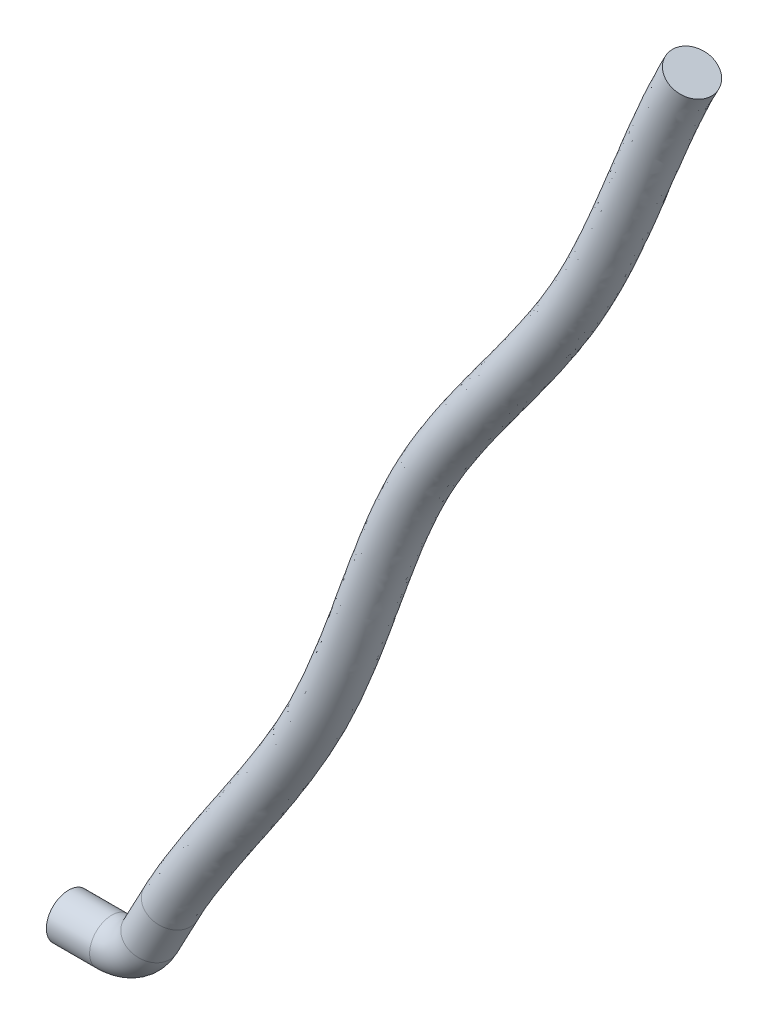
ISO-10303-21;
HEADER;
FILE_DESCRIPTION(('STEP AP214'),'2;1');
FILE_NAME('part.step','',(''),(''),'','','');
FILE_SCHEMA(('AUTOMOTIVE_DESIGN { 1 0 10303 214 1 1 1 1 }'));
ENDSEC;
DATA;
#1=APPLICATION_CONTEXT('core data for automotive mechanical design processes');
#2=APPLICATION_PROTOCOL_DEFINITION('international standard','automotive_design',2000,#1);
#3=PRODUCT_CONTEXT('',#1,'mechanical');
#4=PRODUCT('Part','Part','',(#3));
#5=PRODUCT_RELATED_PRODUCT_CATEGORY('part','',(#4));
#6=PRODUCT_DEFINITION_FORMATION('','',#4);
#7=PRODUCT_DEFINITION_CONTEXT('part definition',#1,'design');
#8=PRODUCT_DEFINITION('design','',#6,#7);
#9=PRODUCT_DEFINITION_SHAPE('','',#8);
#10=(LENGTH_UNIT() NAMED_UNIT(*) SI_UNIT(.MILLI.,.METRE.));
#11=(NAMED_UNIT(*) PLANE_ANGLE_UNIT() SI_UNIT($,.RADIAN.));
#12=(NAMED_UNIT(*) SI_UNIT($,.STERADIAN.) SOLID_ANGLE_UNIT());
#13=UNCERTAINTY_MEASURE_WITH_UNIT(LENGTH_MEASURE(1.E-05),#10,'distance_accuracy_value','');
#14=(GEOMETRIC_REPRESENTATION_CONTEXT(3) GLOBAL_UNCERTAINTY_ASSIGNED_CONTEXT((#13)) GLOBAL_UNIT_ASSIGNED_CONTEXT((#10,
#11,#12)) REPRESENTATION_CONTEXT('',''));
#15=CARTESIAN_POINT('',(0.,0.,0.));
#16=DIRECTION('',(0.,0.,1.));
#17=DIRECTION('',(1.,0.,0.));
#18=AXIS2_PLACEMENT_3D('',#15,#16,#17);
#19=CARTESIAN_POINT('',(4.11647379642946,1.62326427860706,0.));
#20=DIRECTION('',(0.469471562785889,0.882947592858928,0.));
#21=DIRECTION('',(-0.882947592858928,0.469471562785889,0.));
#22=AXIS2_PLACEMENT_3D('',#19,#20,#21);
#23=CYLINDRICAL_SURFACE('',#22,0.254);
#24=CARTESIAN_POINT('',(4.11647379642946,1.62326427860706,0.));
#25=DIRECTION('',(0.469471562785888,0.882947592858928,0.));
#26=DIRECTION('',(0.,0.,1.));
#27=AXIS2_PLACEMENT_3D('',#24,#25,#26);
#28=CIRCLE('',#27,0.254);
#29=CARTESIAN_POINT('',(4.34074248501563,1.50401850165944,0.));
#30=VERTEX_POINT('',#29);
#31=EDGE_CURVE('E56',#30,#30,#28,.T.);
#32=ORIENTED_EDGE('',*,*,#31,.T.);
#33=EDGE_LOOP('',(#32));
#34=FACE_BOUND('',#33,.T.);
#35=CARTESIAN_POINT('',(4.35120957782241,2.06473807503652,0.));
#36=DIRECTION('',(0.469471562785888,0.882947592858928,0.));
#37=DIRECTION('',(0.,0.,1.));
#38=AXIS2_PLACEMENT_3D('',#35,#36,#37);
#39=CIRCLE('',#38,0.254);
#40=CARTESIAN_POINT('',(4.35120957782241,2.06473807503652,0.254));
#41=VERTEX_POINT('',#40);
#42=EDGE_CURVE('E52',#41,#41,#39,.T.);
#43=ORIENTED_EDGE('',*,*,#42,.F.);
#44=EDGE_LOOP('',(#43));
#45=FACE_BOUND('',#44,.T.);
#46=ADVANCED_FACE('F46',(#34,#45),#23,.T.);
#47=CARTESIAN_POINT('',(3.675,1.85800006,0.));
#48=DIRECTION('',(0.,0.,1.));
#49=DIRECTION('',(1.,0.,0.));
#50=AXIS2_PLACEMENT_3D('',#47,#48,#49);
#51=TOROIDAL_SURFACE('',#50,0.5,0.254);
#52=CARTESIAN_POINT('',(3.675,1.35800006,0.));
#53=DIRECTION('',(1.,0.,0.));
#54=DIRECTION('',(0.,0.,1.));
#55=AXIS2_PLACEMENT_3D('',#52,#53,#54);
#56=CIRCLE('',#55,0.254);
#57=CARTESIAN_POINT('',(3.675,1.10400006,0.));
#58=VERTEX_POINT('',#57);
#59=EDGE_CURVE('E60',#58,#58,#56,.T.);
#60=CARTESIAN_POINT('',(3.675,1.85800006,0.));
#61=DIRECTION('',(0.,0.,1.));
#62=DIRECTION('',(1.,0.,0.));
#63=AXIS2_PLACEMENT_3D('',#60,#61,#62);
#64=CIRCLE('',#63,0.754);
#65=EDGE_CURVE('',#58,#30,#64,.T.);
#66=ORIENTED_EDGE('',*,*,#59,.T.);
#67=ORIENTED_EDGE('',*,*,#31,.F.);
#68=ORIENTED_EDGE('',*,*,#65,.T.);
#69=ORIENTED_EDGE('',*,*,#65,.F.);
#70=EDGE_LOOP('',(#66,#68,#67,#69));
#71=FACE_BOUND('',#70,.T.);
#72=ADVANCED_FACE('F85',(#71),#51,.T.);
#73=CARTESIAN_POINT('',(0.5,1.35800006,0.));
#74=DIRECTION('',(1.,0.,0.));
#75=DIRECTION('',(0.,1.,0.));
#76=AXIS2_PLACEMENT_3D('',#73,#74,#75);
#77=CYLINDRICAL_SURFACE('',#76,0.254);
#78=CARTESIAN_POINT('',(3.18,1.35800006,0.));
#79=DIRECTION('',(1.,0.,0.));
#80=DIRECTION('',(0.,0.,-1.));
#81=AXIS2_PLACEMENT_3D('',#78,#79,#80);
#82=CIRCLE('',#81,0.254);
#83=CARTESIAN_POINT('',(3.18,1.35800006,-0.254));
#84=VERTEX_POINT('',#83);
#85=EDGE_CURVE('E11',#84,#84,#82,.F.);
#86=ORIENTED_EDGE('',*,*,#85,.F.);
#87=EDGE_LOOP('',(#86));
#88=FACE_BOUND('',#87,.T.);
#89=ORIENTED_EDGE('',*,*,#59,.F.);
#90=EDGE_LOOP('',(#89));
#91=FACE_BOUND('',#90,.T.);
#92=ADVANCED_FACE('F80',(#88,#91),#77,.T.);
#93=CARTESIAN_POINT('',(10.3134984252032,13.2781725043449,0.));
#94=DIRECTION('',(0.469471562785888,0.882947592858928,0.));
#95=DIRECTION('',(0.,0.,1.));
#96=AXIS2_PLACEMENT_3D('',#93,#94,#95);
#97=PLANE('',#96);
#98=CARTESIAN_POINT('',(10.3134984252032,13.2781725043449,0.));
#99=DIRECTION('',(0.469471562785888,0.882947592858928,0.));
#100=DIRECTION('',(0.,0.,1.));
#101=AXIS2_PLACEMENT_3D('',#98,#99,#100);
#102=CIRCLE('',#101,0.254);
#103=CARTESIAN_POINT('',(10.3134984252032,13.2781725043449,0.254));
#104=VERTEX_POINT('',#103);
#105=EDGE_CURVE('E65',#104,#104,#102,.T.);
#106=ORIENTED_EDGE('',*,*,#105,.T.);
#107=EDGE_LOOP('',(#106));
#108=FACE_BOUND('',#107,.T.);
#109=ADVANCED_FACE('F69',(#108),#97,.T.);
#110=CARTESIAN_POINT('',(4.35120957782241,2.06473807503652,0.254));
#111=CARTESIAN_POINT('',(4.60273142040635,2.53778186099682,0.254));
#112=CARTESIAN_POINT('',(5.2157873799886,3.40681610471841,0.254));
#113=CARTESIAN_POINT('',(5.88756704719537,4.45571588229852,0.254));
#114=CARTESIAN_POINT('',(6.39902438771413,5.55647184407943,0.254));
#115=CARTESIAN_POINT('',(6.72430496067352,6.57902234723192,0.254));
#116=CARTESIAN_POINT('',(7.18003008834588,7.65794001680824,0.254));
#117=CARTESIAN_POINT('',(7.81169698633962,8.67560401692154,0.254));
#118=CARTESIAN_POINT('',(8.48276043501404,9.51116998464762,0.254));
#119=CARTESIAN_POINT('',(9.15156772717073,10.5882995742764,0.254));
#120=CARTESIAN_POINT('',(9.67330975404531,11.7766746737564,0.254));
#121=CARTESIAN_POINT('',(10.0474594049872,12.7778258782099,0.254));
#122=CARTESIAN_POINT('',(10.3134984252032,13.2781725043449,0.254));
#123=CARTESIAN_POINT('',(4.79974695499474,1.82624652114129,0.254));
#124=CARTESIAN_POINT('',(5.05126879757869,2.29929030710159,0.254));
#125=CARTESIAN_POINT('',(5.61734447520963,3.08836460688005,0.254));
#126=CARTESIAN_POINT('',(6.33132704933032,4.21179144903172,0.254));
#127=CARTESIAN_POINT('',(6.87916484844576,5.38000253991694,0.254));
#128=CARTESIAN_POINT('',(7.21286594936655,6.42532035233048,0.254));
#129=CARTESIAN_POINT('',(7.62712145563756,7.4245115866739,0.254));
#130=CARTESIAN_POINT('',(8.21874390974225,8.3635976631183,0.254));
#131=CARTESIAN_POINT('',(8.89233489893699,9.20367775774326,0.254));
#132=CARTESIAN_POINT('',(9.59893617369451,10.353288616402,0.254));
#133=CARTESIAN_POINT('',(10.1618807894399,11.6199829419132,0.254));
#134=CARTESIAN_POINT('',(10.4959967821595,12.5393343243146,0.254));
#135=CARTESIAN_POINT('',(10.7620358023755,13.0396809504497,0.254));
#136=CARTESIAN_POINT('',(4.79974695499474,1.82624652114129,-0.254));
#137=CARTESIAN_POINT('',(5.05126879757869,2.29929030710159,-0.254));
#138=CARTESIAN_POINT('',(5.61734447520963,3.08836460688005,-0.254));
#139=CARTESIAN_POINT('',(6.33132704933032,4.21179144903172,-0.254));
#140=CARTESIAN_POINT('',(6.87916484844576,5.38000253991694,-0.254));
#141=CARTESIAN_POINT('',(7.21286594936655,6.42532035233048,-0.254));
#142=CARTESIAN_POINT('',(7.62712145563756,7.4245115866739,-0.254));
#143=CARTESIAN_POINT('',(8.21874390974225,8.3635976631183,-0.254));
#144=CARTESIAN_POINT('',(8.89233489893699,9.20367775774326,-0.254));
#145=CARTESIAN_POINT('',(9.59893617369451,10.353288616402,-0.254));
#146=CARTESIAN_POINT('',(10.1618807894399,11.6199829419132,-0.254));
#147=CARTESIAN_POINT('',(10.4959967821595,12.5393343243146,-0.254));
#148=CARTESIAN_POINT('',(10.7620358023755,13.0396809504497,-0.254));
#149=CARTESIAN_POINT('',(4.35120957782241,2.06473807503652,-0.254));
#150=CARTESIAN_POINT('',(4.60273142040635,2.53778186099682,-0.254));
#151=CARTESIAN_POINT('',(5.2157873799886,3.40681610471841,-0.254));
#152=CARTESIAN_POINT('',(5.88756704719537,4.45571588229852,-0.254));
#153=CARTESIAN_POINT('',(6.39902438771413,5.55647184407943,-0.254));
#154=CARTESIAN_POINT('',(6.72430496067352,6.57902234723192,-0.254));
#155=CARTESIAN_POINT('',(7.18003008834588,7.65794001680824,-0.254));
#156=CARTESIAN_POINT('',(7.81169698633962,8.67560401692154,-0.254));
#157=CARTESIAN_POINT('',(8.48276043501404,9.51116998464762,-0.254));
#158=CARTESIAN_POINT('',(9.15156772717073,10.5882995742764,-0.254));
#159=CARTESIAN_POINT('',(9.67330975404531,11.7766746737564,-0.254));
#160=CARTESIAN_POINT('',(10.0474594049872,12.7778258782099,-0.254));
#161=CARTESIAN_POINT('',(10.3134984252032,13.2781725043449,-0.254));
#162=CARTESIAN_POINT('',(3.90267220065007,2.30322962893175,-0.254));
#163=CARTESIAN_POINT('',(4.15419404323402,2.77627341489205,-0.254));
#164=CARTESIAN_POINT('',(4.81423028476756,3.72526760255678,-0.254));
#165=CARTESIAN_POINT('',(5.44380704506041,4.69964031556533,-0.254));
#166=CARTESIAN_POINT('',(5.9188839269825,5.73294114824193,-0.254));
#167=CARTESIAN_POINT('',(6.2357439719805,6.73272434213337,-0.254));
#168=CARTESIAN_POINT('',(6.7329387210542,7.89136844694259,-0.254));
#169=CARTESIAN_POINT('',(7.40465006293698,8.98761037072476,-0.254));
#170=CARTESIAN_POINT('',(8.07318597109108,9.81866221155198,-0.254));
#171=CARTESIAN_POINT('',(8.70419928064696,10.8233105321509,-0.254));
#172=CARTESIAN_POINT('',(9.18473871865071,11.9333664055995,-0.254));
#173=CARTESIAN_POINT('',(9.59892202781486,13.0163174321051,-0.254));
#174=CARTESIAN_POINT('',(9.86496104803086,13.5166640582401,-0.254));
#175=CARTESIAN_POINT('',(3.90267220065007,2.30322962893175,0.254));
#176=CARTESIAN_POINT('',(4.15419404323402,2.77627341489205,0.254));
#177=CARTESIAN_POINT('',(4.81423028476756,3.72526760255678,0.254));
#178=CARTESIAN_POINT('',(5.44380704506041,4.69964031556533,0.254));
#179=CARTESIAN_POINT('',(5.9188839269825,5.73294114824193,0.254));
#180=CARTESIAN_POINT('',(6.2357439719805,6.73272434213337,0.254));
#181=CARTESIAN_POINT('',(6.7329387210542,7.89136844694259,0.254));
#182=CARTESIAN_POINT('',(7.40465006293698,8.98761037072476,0.254));
#183=CARTESIAN_POINT('',(8.07318597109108,9.81866221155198,0.254));
#184=CARTESIAN_POINT('',(8.70419928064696,10.8233105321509,0.254));
#185=CARTESIAN_POINT('',(9.18473871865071,11.9333664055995,0.254));
#186=CARTESIAN_POINT('',(9.59892202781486,13.0163174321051,0.254));
#187=CARTESIAN_POINT('',(9.86496104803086,13.5166640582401,0.254));
#188=CARTESIAN_POINT('',(4.35120957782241,2.06473807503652,0.254));
#189=CARTESIAN_POINT('',(4.60273142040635,2.53778186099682,0.254));
#190=CARTESIAN_POINT('',(5.2157873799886,3.40681610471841,0.254));
#191=CARTESIAN_POINT('',(5.88756704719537,4.45571588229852,0.254));
#192=CARTESIAN_POINT('',(6.39902438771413,5.55647184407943,0.254));
#193=CARTESIAN_POINT('',(6.72430496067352,6.57902234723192,0.254));
#194=CARTESIAN_POINT('',(7.18003008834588,7.65794001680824,0.254));
#195=CARTESIAN_POINT('',(7.81169698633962,8.67560401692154,0.254));
#196=CARTESIAN_POINT('',(8.48276043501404,9.51116998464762,0.254));
#197=CARTESIAN_POINT('',(9.15156772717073,10.5882995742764,0.254));
#198=CARTESIAN_POINT('',(9.67330975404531,11.7766746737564,0.254));
#199=CARTESIAN_POINT('',(10.0474594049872,12.7778258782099,0.254));
#200=CARTESIAN_POINT('',(10.3134984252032,13.2781725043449,0.254));
#201=(BOUNDED_SURFACE() B_SPLINE_SURFACE(3,3,((#110,#111,#112,#113,#114,#115,#116,#117,#118,
#119,#120,#121,#122),(#123,#124,#125,#126,#127,#128,#129,#130,#131,#132,#133,#134,#135),(#136,
#137,#138,#139,#140,#141,#142,#143,#144,#145,#146,#147,#148),(#149,#150,#151,#152,#153,#154,
#155,#156,#157,#158,#159,#160,#161),(#162,#163,#164,#165,#166,#167,#168,#169,#170,#171,#172,
#173,#174),(#175,#176,#177,#178,#179,#180,#181,#182,#183,#184,#185,#186,#187),(#188,#189,#190,
#191,#192,#193,#194,#195,#196,#197,#198,#199,#200)),.UNSPECIFIED.,.T.,.F.,
.F.) B_SPLINE_SURFACE_WITH_KNOTS((4,3,4),(4,1,1,1,1,1,1,1,1,1,4),(0.,0.5,1.),(0.,
0.140000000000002,0.249655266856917,0.28,0.419999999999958,0.5,0.560000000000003,
0.706666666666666,0.750344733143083,0.85333333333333,1.),
.UNSPECIFIED.) GEOMETRIC_REPRESENTATION_ITEM() RATIONAL_B_SPLINE_SURFACE(((1.,1.,1.,1.,1.,1.,1.,
1.,1.,1.,1.,1.,1.),(0.333333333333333,0.333333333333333,0.333333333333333,0.333333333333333,
0.333333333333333,0.333333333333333,0.333333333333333,0.333333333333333,0.333333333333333,
0.333333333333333,0.333333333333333,0.333333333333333,0.333333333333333),(0.333333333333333,
0.333333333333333,0.333333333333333,0.333333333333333,0.333333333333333,0.333333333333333,
0.333333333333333,0.333333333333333,0.333333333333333,0.333333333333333,0.333333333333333,
0.333333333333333,0.333333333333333),(1.,1.,1.,1.,1.,1.,1.,1.,1.,1.,1.,1.,1.),
(0.333333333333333,0.333333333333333,0.333333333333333,0.333333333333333,0.333333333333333,
0.333333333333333,0.333333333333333,0.333333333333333,0.333333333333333,0.333333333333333,
0.333333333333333,0.333333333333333,0.333333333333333),(0.333333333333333,0.333333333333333,
0.333333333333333,0.333333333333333,0.333333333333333,0.333333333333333,0.333333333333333,
0.333333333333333,0.333333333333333,0.333333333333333,0.333333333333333,0.333333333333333,
0.333333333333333),(1.,1.,1.,1.,1.,1.,1.,1.,1.,1.,1.,1.,1.))) REPRESENTATION_ITEM('') SURFACE());
#202=CARTESIAN_POINT('',(4.35120957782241,2.06473807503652,0.254));
#203=CARTESIAN_POINT('',(4.35472363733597,2.07134705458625,0.254));
#204=CARTESIAN_POINT('',(4.35825057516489,2.07794918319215,0.254));
#205=CARTESIAN_POINT('',(4.36533976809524,2.09115907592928,0.254));
#206=CARTESIAN_POINT('',(4.36890209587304,2.09776680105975,0.254));
#207=CARTESIAN_POINT('',(4.37606154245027,2.11098792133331,0.254));
#208=CARTESIAN_POINT('',(4.37965873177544,2.11760127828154,0.254));
#209=CARTESIAN_POINT('',(4.38688737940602,2.13083369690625,0.254));
#210=CARTESIAN_POINT('',(4.39051890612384,2.13745272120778,0.254));
#211=CARTESIAN_POINT('',(4.39781570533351,2.15069650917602,0.254));
#212=CARTESIAN_POINT('',(4.40148104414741,2.15732123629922,0.254));
#213=CARTESIAN_POINT('',(4.40884494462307,2.17057646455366,0.254));
#214=CARTESIAN_POINT('',(4.41254357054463,2.17720692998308,0.254));
#215=CARTESIAN_POINT('',(4.4199735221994,2.19047366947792,0.254));
#216=CARTESIAN_POINT('',(4.4237049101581,2.19710990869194,0.254));
#217=CARTESIAN_POINT('',(4.43119986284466,2.21038823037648,0.254));
#218=CARTESIAN_POINT('',(4.4349634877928,2.21703027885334,0.254));
#219=CARTESIAN_POINT('',(4.4425223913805,2.23032025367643,0.254));
#220=CARTESIAN_POINT('',(4.44631772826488,2.23696814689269,0.254));
#221=CARTESIAN_POINT('',(4.45393953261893,2.25026984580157,0.254));
#222=CARTESIAN_POINT('',(4.45776605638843,2.25692361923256,0.254));
#223=CARTESIAN_POINT('',(4.46544971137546,2.27023711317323,0.254));
#224=CARTESIAN_POINT('',(4.46930689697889,2.27689680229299,0.254));
#225=CARTESIAN_POINT('',(4.47705135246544,2.29022216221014,0.254));
#226=CARTESIAN_POINT('',(4.48093867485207,2.2968878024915,0.254));
#227=CARTESIAN_POINT('',(4.48874288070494,2.31022509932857,0.254));
#228=CARTESIAN_POINT('',(4.49265981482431,2.31689672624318,0.254));
#229=CARTESIAN_POINT('',(4.50052272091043,2.3302460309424,0.254));
#230=CARTESIAN_POINT('',(4.50446874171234,2.33692367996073,0.254));
#231=CARTESIAN_POINT('',(4.51238929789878,2.35028506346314,0.254));
#232=CARTESIAN_POINT('',(4.51636388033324,2.35696877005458,0.254));
#233=CARTESIAN_POINT('',(4.52434103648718,2.37034230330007,0.254));
#234=CARTESIAN_POINT('',(4.52834365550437,2.37703210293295,0.254));
#235=CARTESIAN_POINT('',(4.53637636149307,2.3904178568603,0.254));
#236=CARTESIAN_POINT('',(4.54040649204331,2.39711378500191,0.254));
#237=CARTESIAN_POINT('',(4.54849369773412,2.41051183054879,0.254));
#238=CARTESIAN_POINT('',(4.55255081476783,2.41721392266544,0.254));
#239=CARTESIAN_POINT('',(4.56069147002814,2.43062433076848,0.254));
#240=CARTESIAN_POINT('',(4.56477504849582,2.43733262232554,0.254));
#241=CARTESIAN_POINT('',(4.57296810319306,2.45075546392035,0.254));
#242=CARTESIAN_POINT('',(4.57707761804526,2.45746999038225,0.254));
#243=CARTESIAN_POINT('',(4.58532202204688,2.47090533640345,0.254));
#244=CARTESIAN_POINT('',(4.58945694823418,2.47762613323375,0.254));
#245=CARTESIAN_POINT('',(4.59775165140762,2.49107405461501,0.254));
#246=CARTESIAN_POINT('',(4.60191146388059,2.49780115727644,0.254));
#247=CARTESIAN_POINT('',(4.61025541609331,2.51126172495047,0.254));
#248=CARTESIAN_POINT('',(4.61443958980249,2.51799516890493,0.254));
#249=CARTESIAN_POINT('',(4.62283174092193,2.53146845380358,0.254));
#250=CARTESIAN_POINT('',(4.62703975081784,2.53820827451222,0.254));
#251=CARTESIAN_POINT('',(4.63547905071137,2.55169434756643,0.254));
#252=CARTESIAN_POINT('',(4.63971037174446,2.55844058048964,0.254));
#253=CARTESIAN_POINT('',(4.64819577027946,2.57193951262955,0.254));
#254=CARTESIAN_POINT('',(4.6524498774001,2.57869219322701,0.254));
#255=CARTESIAN_POINT('',(4.66098032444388,2.59220405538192,0.254));
#256=CARTESIAN_POINT('',(4.66525669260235,2.59896321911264,0.254));
#257=CARTESIAN_POINT('',(4.67383113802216,2.61248808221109,0.254));
#258=CARTESIAN_POINT('',(4.67812924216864,2.61925376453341,0.254));
#259=CARTESIAN_POINT('',(4.68674663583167,2.63279169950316,0.254));
#260=CARTESIAN_POINT('',(4.69106595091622,2.63956393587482,0.254));
#261=CARTESIAN_POINT('',(4.6997252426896,2.65311501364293,0.254));
#262=CARTESIAN_POINT('',(4.70406524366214,2.65989383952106,0.254));
#263=CARTESIAN_POINT('',(4.71276538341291,2.67345813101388,0.254));
#264=CARTESIAN_POINT('',(4.71712554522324,2.68024358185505,0.254));
#265=CARTESIAN_POINT('',(4.72586548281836,2.69382115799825,0.254));
#266=CARTESIAN_POINT('',(4.73024528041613,2.7006132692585,0.254));
#267=CARTESIAN_POINT('',(4.73902396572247,2.7142042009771,0.254));
#268=CARTESIAN_POINT('',(4.74342287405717,2.72100300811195,0.254));
#269=CARTESIAN_POINT('',(4.75223925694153,2.73460736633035,0.254));
#270=CARTESIAN_POINT('',(4.75665675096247,2.74141290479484,0.254));
#271=CARTESIAN_POINT('',(4.76550978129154,2.75503076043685,0.254));
#272=CARTESIAN_POINT('',(4.7699453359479,2.76184306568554,0.254));
#273=CARTESIAN_POINT('',(4.77883396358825,2.77547448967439,0.254));
#274=CARTESIAN_POINT('',(4.78328705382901,2.78229359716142,0.254));
#275=CARTESIAN_POINT('',(4.79221022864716,2.79593866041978,0.254));
#276=CARTESIAN_POINT('',(4.79668032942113,2.80276460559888,0.254));
#277=CARTESIAN_POINT('',(4.80563700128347,2.8164233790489,0.254));
#278=CARTESIAN_POINT('',(4.81012358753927,2.82325619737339,0.254));
#279=CARTESIAN_POINT('',(4.81911270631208,2.83692875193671,0.254));
#280=CARTESIAN_POINT('',(4.82361525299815,2.84376847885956,0.254));
#281=CARTESIAN_POINT('',(4.83263576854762,2.85745488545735,0.254));
#282=CARTESIAN_POINT('',(4.83715375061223,2.86430155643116,0.254));
#283=CARTESIAN_POINT('',(4.84620461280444,2.87800188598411,0.254));
#284=CARTESIAN_POINT('',(4.85073750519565,2.88485553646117,0.254));
#285=CARTESIAN_POINT('',(4.85981766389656,2.89856985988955,0.254));
#286=CARTESIAN_POINT('',(4.86436494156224,2.90543052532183,0.254));
#287=CARTESIAN_POINT('',(4.87347334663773,2.91915891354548,0.254));
#288=CARTESIAN_POINT('',(4.87803448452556,2.92602662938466,0.254));
#289=CARTESIAN_POINT('',(4.88717008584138,2.93976915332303,0.254));
#290=CARTESIAN_POINT('',(4.89174455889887,2.94664395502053,0.254));
#291=CARTESIAN_POINT('',(4.90090630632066,2.96040068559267,0.254));
#292=CARTESIAN_POINT('',(4.9054935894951,2.96728260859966,0.254));
#293=CARTESIAN_POINT('',(4.9146804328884,2.98105361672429,0.254));
#294=CARTESIAN_POINT('',(4.9192800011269,2.98794269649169,0.254));
#295=CARTESIAN_POINT('',(4.92849089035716,3.00172805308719,0.254));
#296=CARTESIAN_POINT('',(4.93310221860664,3.00862432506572,0.254));
#297=CARTESIAN_POINT('',(4.94233610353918,3.02242410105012,0.254));
#298=CARTESIAN_POINT('',(4.94695866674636,3.0293276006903,0.254));
#299=CARTESIAN_POINT('',(4.95621449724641,3.04314186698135,0.254));
#300=CARTESIAN_POINT('',(4.96084777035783,3.05005262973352,0.254));
#301=CARTESIAN_POINT('',(4.97012449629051,3.06388145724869,0.254));
#302=CARTESIAN_POINT('',(4.97476795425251,3.07079951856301,0.254));
#303=CARTESIAN_POINT('',(4.98406452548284,3.08464297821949,0.254));
#304=CARTESIAN_POINT('',(4.98871764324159,3.09156837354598,0.254));
#305=CARTESIAN_POINT('',(4.99803300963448,3.10542653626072,0.254));
#306=CARTESIAN_POINT('',(5.00269526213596,3.11235930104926,0.254));
#307=CARTESIAN_POINT('',(5.01202837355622,3.12623223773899,0.254));
#308=CARTESIAN_POINT('',(5.01669923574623,3.13317240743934,0.254));
#309=CARTESIAN_POINT('',(5.02604904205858,3.14706018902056,0.254));
#310=CARTESIAN_POINT('',(5.03072798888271,3.15400779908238,0.254));
#311=CARTESIAN_POINT('',(5.04009343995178,3.16791049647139,0.254));
#312=CARTESIAN_POINT('',(5.04477994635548,3.17486558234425,0.254));
#313=CARTESIAN_POINT('',(5.05415999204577,3.18878326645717,0.254));
#314=CARTESIAN_POINT('',(5.0588535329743,3.19574586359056,0.254));
#315=CARTESIAN_POINT('',(5.06824712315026,3.20967860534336,0.254));
#316=CARTESIAN_POINT('',(5.07294717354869,3.2166487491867,0.254));
#317=CARTESIAN_POINT('',(5.08235325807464,3.23059661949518,0.254));
#318=CARTESIAN_POINT('',(5.0870592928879,3.23757434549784,0.254));
#319=CARTESIAN_POINT('',(5.09647682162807,3.25153741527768,0.254));
#320=CARTESIAN_POINT('',(5.10118831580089,3.258522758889,0.254));
#321=CARTESIAN_POINT('',(5.11061623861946,3.27250109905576,0.254));
#322=CARTESIAN_POINT('',(5.11533266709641,3.27949409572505,0.254));
#323=CARTESIAN_POINT('',(5.12476993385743,3.29348777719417,0.254));
#324=CARTESIAN_POINT('',(5.12949077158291,3.30048846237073,0.254));
#325=CARTESIAN_POINT('',(5.13893633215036,3.31449755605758,0.254));
#326=CARTESIAN_POINT('',(5.14366105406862,3.3215059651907,0.254));
#327=CARTESIAN_POINT('',(5.1531138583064,3.33553054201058,0.254));
#328=CARTESIAN_POINT('',(5.15784193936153,3.34254671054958,0.254));
#329=CARTESIAN_POINT('',(5.16730093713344,3.3565868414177,0.254));
#330=CARTESIAN_POINT('',(5.17203185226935,3.36361080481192,0.254));
#331=CARTESIAN_POINT('',(5.18149599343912,3.37766656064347,0.254));
#332=CARTESIAN_POINT('',(5.18622921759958,3.38469835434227,0.254));
#333=CARTESIAN_POINT('',(5.19569745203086,3.3987698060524,0.254));
#334=CARTESIAN_POINT('',(5.20043246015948,3.4058094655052,0.254));
#335=CARTESIAN_POINT('',(5.20990373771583,3.41989668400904,0.254));
#336=CARTESIAN_POINT('',(5.21464000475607,3.42694424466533,0.254));
#337=CARTESIAN_POINT('',(5.22411327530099,3.44104730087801,0.254));
#338=CARTESIAN_POINT('',(5.22885027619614,3.44810279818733,0.254));
#339=CARTESIAN_POINT('',(5.23832448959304,3.46222176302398,0.254));
#340=CARTESIAN_POINT('',(5.24306169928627,3.46928523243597,0.254));
#341=CARTESIAN_POINT('',(5.25253580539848,3.48342017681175,0.254));
#342=CARTESIAN_POINT('',(5.25727269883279,3.49049165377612,0.254));
#343=CARTESIAN_POINT('',(5.26674564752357,3.50464264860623,0.254));
#344=CARTESIAN_POINT('',(5.27148169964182,3.51172216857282,0.254));
#345=CARTESIAN_POINT('',(5.28095244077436,3.52588928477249,0.254));
#346=CARTESIAN_POINT('',(5.28568712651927,3.53297688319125,0.254));
#347=CARTESIAN_POINT('',(5.29515460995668,3.54716019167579,0.254));
#348=CARTESIAN_POINT('',(5.2998874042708,3.55425590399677,0.254));
#349=CARTESIAN_POINT('',(5.30935057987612,3.56845547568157,0.254));
#350=CARTESIAN_POINT('',(5.31408095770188,3.57555933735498,0.254));
#351=CARTESIAN_POINT('',(5.32353877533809,3.58977524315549,0.254));
#352=CARTESIAN_POINT('',(5.32826621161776,3.5968872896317,0.254));
#353=CARTESIAN_POINT('',(5.33771762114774,3.61111960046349,0.254));
#354=CARTESIAN_POINT('',(5.34244159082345,3.61823986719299,0.254));
#355=CARTESIAN_POINT('',(5.35188554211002,3.63248865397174,0.254));
#356=CARTESIAN_POINT('',(5.35660552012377,3.63961717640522,0.254));
#357=CARTESIAN_POINT('',(5.3660409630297,3.65388251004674,0.254));
#358=CARTESIAN_POINT('',(5.3707564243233,3.66101932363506,0.254));
#359=CARTESIAN_POINT('',(5.38018230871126,3.67530127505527,0.254));
#360=CARTESIAN_POINT('',(5.38489272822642,3.68244641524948,0.254));
#361=CARTESIAN_POINT('',(5.39430800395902,3.69674505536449,0.254));
#362=CARTESIAN_POINT('',(5.39901285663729,3.70389855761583,0.254));
#363=CARTESIAN_POINT('',(5.40841647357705,3.71821395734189,0.254));
#364=CARTESIAN_POINT('',(5.41311523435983,3.72537585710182,0.254));
#365=CARTESIAN_POINT('',(5.42250614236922,3.73970808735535,0.254));
#366=CARTESIAN_POINT('',(5.42719828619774,3.74687842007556,0.254));
#367=CARTESIAN_POINT('',(5.43657543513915,3.76122755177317,0.254));
#368=CARTESIAN_POINT('',(5.44126043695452,3.76840635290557,0.254));
#369=CARTESIAN_POINT('',(5.45062277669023,3.78277245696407,0.254));
#370=CARTESIAN_POINT('',(5.45530011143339,3.78995976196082,0.254));
#371=CARTESIAN_POINT('',(5.46464659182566,3.80434290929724,0.254));
#372=CARTESIAN_POINT('',(5.46931573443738,3.81153875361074,0.254));
#373=CARTESIAN_POINT('',(5.47864530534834,3.82593901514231,0.254));
#374=CARTESIAN_POINT('',(5.48330573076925,3.83314343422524,0.254));
#375=CARTESIAN_POINT('',(5.49261734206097,3.84756088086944,0.254));
#376=CARTESIAN_POINT('',(5.49726852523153,3.85477391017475,0.254));
#377=CARTESIAN_POINT('',(5.506561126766,3.86920861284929,0.254));
#378=CARTESIAN_POINT('',(5.51120254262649,3.87643028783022,0.254));
#379=CARTESIAN_POINT('',(5.52047508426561,3.89088231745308,0.254));
#380=CARTESIAN_POINT('',(5.52510620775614,3.89811267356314,0.254));
#381=CARTESIAN_POINT('',(5.53435763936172,3.91258210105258,0.254));
#382=CARTESIAN_POINT('',(5.53897794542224,3.91982117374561,0.254));
#383=CARTESIAN_POINT('',(5.54820721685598,3.93430807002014,0.254));
#384=CARTESIAN_POINT('',(5.55281618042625,3.9415558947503,0.254));
#385=CARTESIAN_POINT('',(5.56202224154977,3.95606033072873,0.254));
#386=CARTESIAN_POINT('',(5.56661933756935,3.96331694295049,0.254));
#387=CARTESIAN_POINT('',(5.57580113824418,3.97783898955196,0.254));
#388=CARTESIAN_POINT('',(5.58038584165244,3.98510442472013,0.254));
#389=CARTESIAN_POINT('',(5.58954233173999,3.99964415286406,0.254));
#390=CARTESIAN_POINT('',(5.5941141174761,4.00691844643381,0.254));
#391=CARTESIAN_POINT('',(5.60324424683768,4.02147592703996,0.254));
#392=CARTESIAN_POINT('',(5.60780258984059,4.02875911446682,0.254));
#393=CARTESIAN_POINT('',(5.6169053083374,4.04333441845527,0.254));
#394=CARTESIAN_POINT('',(5.62144968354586,4.05062653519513,0.254));
#395=CARTESIAN_POINT('',(5.63052394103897,4.06521973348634,0.254));
#396=CARTESIAN_POINT('',(5.63505382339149,4.07252081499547,0.254));
#397=CARTESIAN_POINT('',(5.64409856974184,4.08713197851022,0.254));
#398=CARTESIAN_POINT('',(5.64861343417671,4.09444206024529,0.254));
#399=CARTESIAN_POINT('',(5.65762761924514,4.10907125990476,0.254));
#400=CARTESIAN_POINT('',(5.66212694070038,4.11639037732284,0.254));
#401=CARTESIAN_POINT('',(5.67110951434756,4.13103768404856,0.254));
#402=CARTESIAN_POINT('',(5.67559276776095,4.13836587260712,0.254));
#403=CARTESIAN_POINT('',(5.68454267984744,4.15303135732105,0.254));
#404=CARTESIAN_POINT('',(5.6890093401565,4.16036865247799,0.254));
#405=CARTESIAN_POINT('',(5.69792554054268,4.17505238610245,0.254));
#406=CARTESIAN_POINT('',(5.70237508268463,4.18239882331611,0.254));
#407=CARTESIAN_POINT('',(5.71125652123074,4.19710087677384,0.254));
#408=CARTESIAN_POINT('',(5.71568842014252,4.204456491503,0.254));
#409=CARTESIAN_POINT('',(5.72453404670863,4.21917693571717,0.254));
#410=CARTESIAN_POINT('',(5.72894777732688,4.22654176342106,0.254));
#411=CARTESIAN_POINT('',(5.73775654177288,4.24128066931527,0.254));
#412=CARTESIAN_POINT('',(5.74215157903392,4.24865474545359,0.254));
#413=CARTESIAN_POINT('',(5.75092243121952,4.26341218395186,0.254));
#414=CARTESIAN_POINT('',(5.75529825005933,4.27079554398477,0.254));
#415=CARTESIAN_POINT('',(5.76403013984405,4.2855715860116,0.254));
#416=CARTESIAN_POINT('',(5.76838621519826,4.29296426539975,0.254));
#417=CARTESIAN_POINT('',(5.77707809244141,4.30775898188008,0.254));
#418=CARTESIAN_POINT('',(5.78141389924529,4.31516101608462,0.254));
#419=CARTESIAN_POINT('',(5.79006471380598,4.32997447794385,0.254));
#420=CARTESIAN_POINT('',(5.79437972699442,4.33738590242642,0.254));
#421=CARTESIAN_POINT('',(5.80298842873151,4.35221818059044,0.254));
#422=CARTESIAN_POINT('',(5.80728212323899,4.35963903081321,0.254));
#423=CARTESIAN_POINT('',(5.81584766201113,4.37449019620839,0.254));
#424=CARTESIAN_POINT('',(5.82011951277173,4.38192050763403,0.254));
#425=CARTESIAN_POINT('',(5.82864083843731,4.39679063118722,0.254));
#426=CARTESIAN_POINT('',(5.83289032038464,4.40423043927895,0.254));
#427=CARTESIAN_POINT('',(5.84136638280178,4.41911959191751,0.254));
#428=CARTESIAN_POINT('',(5.84559297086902,4.42656893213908,0.254));
#429=CARTESIAN_POINT('',(5.85402271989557,4.44147718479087,0.254));
#430=CARTESIAN_POINT('',(5.85822588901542,4.44893609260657,0.254));
#431=CARTESIAN_POINT('',(5.86660827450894,4.46386351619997,0.254));
#432=CARTESIAN_POINT('',(5.87078749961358,4.47133202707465,0.254));
#433=CARTESIAN_POINT('',(5.87912147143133,4.48627869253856,0.254));
#434=CARTESIAN_POINT('',(5.8832762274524,4.49375684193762,0.254));
#435=CARTESIAN_POINT('',(5.89156073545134,4.50872282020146,0.254));
#436=CARTESIAN_POINT('',(5.89569049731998,4.51621064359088,0.254));
#437=CARTESIAN_POINT('',(5.90392449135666,4.53119600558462,0.254));
#438=CARTESIAN_POINT('',(5.90802873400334,4.53869353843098,0.254));
#439=CARTESIAN_POINT('',(5.91621116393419,4.55369835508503,0.254));
#440=CARTESIAN_POINT('',(5.92028936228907,4.56120563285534,0.254));
#441=CARTESIAN_POINT('',(5.92841917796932,4.57622997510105,0.254));
#442=CARTESIAN_POINT('',(5.93247080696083,4.58374703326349,0.254));
#443=CARTESIAN_POINT('',(5.9405469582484,4.5987909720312,0.254));
#444=CARTESIAN_POINT('',(5.94457149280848,4.60631784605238,0.254));
#445=CARTESIAN_POINT('',(5.95259292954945,4.62138145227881,0.254));
#446=CARTESIAN_POINT('',(5.95658984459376,4.62891817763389,0.254));
#447=CARTESIAN_POINT('',(5.96455551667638,4.64400152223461,0.254));
#448=CARTESIAN_POINT('',(5.96852428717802,4.65154813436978,0.254));
#449=CARTESIAN_POINT('',(5.9764331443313,4.6666512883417,0.254));
#450=CARTESIAN_POINT('',(5.98037324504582,4.67420782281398,0.254));
#451=CARTESIAN_POINT('',(5.98822423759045,4.68933085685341,0.254));
#452=CARTESIAN_POINT('',(5.99213514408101,4.69689734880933,0.254));
#453=CARTESIAN_POINT('',(5.99992722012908,4.71204033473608,0.254));
#454=CARTESIAN_POINT('',(6.00380840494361,4.71961682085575,0.254));
#455=CARTESIAN_POINT('',(6.0115405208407,4.73477982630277,0.254));
#456=CARTESIAN_POINT('',(6.01539146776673,4.7423663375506,0.254));
#457=CARTESIAN_POINT('',(6.02306254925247,4.75754944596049,0.254));
#458=CARTESIAN_POINT('',(6.02688270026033,4.76514603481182,0.254));
#459=CARTESIAN_POINT('',(6.03449182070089,4.78034932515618,0.254));
#460=CARTESIAN_POINT('',(6.03828080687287,4.78795601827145,0.254));
#461=CARTESIAN_POINT('',(6.04582814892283,4.80317925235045,0.254));
#462=CARTESIAN_POINT('',(6.04958652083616,4.81079578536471,0.254));
#463=CARTESIAN_POINT('',(6.05707310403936,4.82603850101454,0.254));
#464=CARTESIAN_POINT('',(6.06080133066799,4.83366467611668,0.254));
#465=CARTESIAN_POINT('',(6.06822811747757,4.84892646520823,0.254));
#466=CARTESIAN_POINT('',(6.07192669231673,4.85656207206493,0.254));
#467=CARTESIAN_POINT('',(6.07929466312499,4.87184251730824,0.254));
#468=CARTESIAN_POINT('',(6.08296407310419,4.87948734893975,0.254));
#469=CARTESIAN_POINT('',(6.09027420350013,4.8947860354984,0.254));
#470=CARTESIAN_POINT('',(6.09391493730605,4.90243988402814,0.254));
#471=CARTESIAN_POINT('',(6.10116820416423,4.91775639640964,0.254));
#472=CARTESIAN_POINT('',(6.10478075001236,4.92541905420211,0.254));
#473=CARTESIAN_POINT('',(6.11197812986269,4.94075297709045,0.254));
#474=CARTESIAN_POINT('',(6.11556297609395,4.94842423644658,0.254));
#475=CARTESIAN_POINT('',(6.12270544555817,4.9637751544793,0.254));
#476=CARTESIAN_POINT('',(6.12626308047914,4.97145480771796,0.254));
#477=CARTESIAN_POINT('',(6.13335161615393,4.98682230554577,0.254));
#478=CARTESIAN_POINT('',(6.13688252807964,4.99451014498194,0.254));
#479=CARTESIAN_POINT('',(6.1439181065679,5.00989380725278,0.254));
#480=CARTESIAN_POINT('',(6.14742278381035,5.01758962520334,0.254));
#481=CARTESIAN_POINT('',(6.15440638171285,5.03298903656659,0.254));
#482=CARTESIAN_POINT('',(6.15788531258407,5.04069262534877,0.254));
#483=CARTESIAN_POINT('',(6.16481790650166,5.05610737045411,0.254));
#484=CARTESIAN_POINT('',(6.16827157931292,5.06381852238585,0.254));
#485=CARTESIAN_POINT('',(6.17515414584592,5.07924818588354,0.254));
#486=CARTESIAN_POINT('',(6.17858304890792,5.08696669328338,0.254));
#487=CARTESIAN_POINT('',(6.18541656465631,5.10241085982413,0.254));
#488=CARTESIAN_POINT('',(6.18882118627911,5.11013651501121,0.254));
#489=CARTESIAN_POINT('',(6.19560662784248,5.12559476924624,0.254));
#490=CARTESIAN_POINT('',(6.19898745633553,5.13332736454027,0.254));
#491=CARTESIAN_POINT('',(6.20572580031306,5.14879929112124,0.254));
#492=CARTESIAN_POINT('',(6.20908332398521,5.15653861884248,0.254));
#493=CARTESIAN_POINT('',(6.2157755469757,5.17202380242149,0.254));
#494=CARTESIAN_POINT('',(6.21911025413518,5.17976965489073,0.254));
#495=CARTESIAN_POINT('',(6.22575733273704,5.19526768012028,0.254));
#496=CARTESIAN_POINT('',(6.22906971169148,5.20301984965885,0.254));
#497=CARTESIAN_POINT('',(6.23567262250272,5.21853030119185,0.254));
#498=CARTESIAN_POINT('',(6.23896316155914,5.22628858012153,0.254));
#499=CARTESIAN_POINT('',(6.2455228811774,5.24181104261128,0.254));
#500=CARTESIAN_POINT('',(6.24879206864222,5.24957522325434,0.254));
#501=CARTESIAN_POINT('',(6.25530957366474,5.2651092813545,0.254));
#502=CARTESIAN_POINT('',(6.2585578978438,5.27287915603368,0.254));
#503=CARTESIAN_POINT('',(6.26503416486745,5.28842439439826,0.254));
#504=CARTESIAN_POINT('',(6.26826211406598,5.29619975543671,0.254));
#505=CARTESIAN_POINT('',(6.27469811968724,5.31175575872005,0.254));
#506=CARTESIAN_POINT('',(6.27790618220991,5.31953639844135,0.254));
#507=CARTESIAN_POINT('',(6.28430290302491,5.33510275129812,0.254));
#508=CARTESIAN_POINT('',(6.2874915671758,5.34288846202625,0.254));
#509=CARTESIAN_POINT('',(6.29384997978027,5.35846474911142,0.254));
#510=CARTESIAN_POINT('',(6.29701973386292,5.36625532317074,0.254));
#511=CARTESIAN_POINT('',(6.30334081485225,5.38184112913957,0.254));
#512=CARTESIAN_POINT('',(6.30649214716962,5.38963635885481,0.254));
#513=CARTESIAN_POINT('',(6.31277687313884,5.40523126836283,0.254));
#514=CARTESIAN_POINT('',(6.31591027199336,5.41303094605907,0.254));
#515=CARTESIAN_POINT('',(6.32215961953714,5.42863454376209,0.254));
#516=CARTESIAN_POINT('',(6.32527557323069,5.43643846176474,0.254));
#517=CARTESIAN_POINT('',(6.33149051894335,5.45205033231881,0.254));
#518=CARTESIAN_POINT('',(6.33458951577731,5.45985828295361,0.254));
#519=CARTESIAN_POINT('',(6.34077103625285,5.47547801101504,0.254));
#520=CARTESIAN_POINT('',(6.34385356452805,5.48328978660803,0.254));
#521=CARTESIAN_POINT('',(6.35000263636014,5.49891695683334,0.254));
#522=CARTESIAN_POINT('',(6.35306918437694,5.50673234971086,0.254));
#523=CARTESIAN_POINT('',(6.35918678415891,5.52236654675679,0.254));
#524=CARTESIAN_POINT('',(6.36223784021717,5.53018534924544,0.254));
#525=CARTESIAN_POINT('',(6.36832494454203,5.54582615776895,0.254));
#526=CARTESIAN_POINT('',(6.37136099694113,5.55364816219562,0.254));
#527=CARTESIAN_POINT('',(6.37741858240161,5.56929516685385,0.254));
#528=CARTESIAN_POINT('',(6.38044011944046,5.57712016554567,0.254));
#529=CARTESIAN_POINT('',(6.38646916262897,5.59277295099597,0.254));
#530=CARTESIAN_POINT('',(6.38947667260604,5.60060073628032,0.254));
#531=CARTESIAN_POINT('',(6.39547815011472,5.6162588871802,0.254));
#532=CARTESIAN_POINT('',(6.39847212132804,5.62408925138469,0.254));
#533=CARTESIAN_POINT('',(6.40444700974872,5.63975235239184,0.254));
#534=CARTESIAN_POINT('',(6.40742793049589,5.64758508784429,0.254));
#535=CARTESIAN_POINT('',(6.41337720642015,5.66325272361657,0.254));
#536=CARTESIAN_POINT('',(6.41634556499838,5.67108762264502,0.254));
#537=CARTESIAN_POINT('',(6.42227020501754,5.68675937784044,0.254));
#538=CARTESIAN_POINT('',(6.42522648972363,5.69459623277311,0.254));
#539=CARTESIAN_POINT('',(6.43112747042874,5.71027169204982,0.254));
#540=CARTESIAN_POINT('',(6.43407216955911,5.71811029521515,0.254));
#541=CARTESIAN_POINT('',(6.439950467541,5.73378904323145,0.254));
#542=CARTESIAN_POINT('',(6.4428840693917,5.74162918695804,0.254));
#543=CARTESIAN_POINT('',(6.44874066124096,5.75731080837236,0.254));
#544=CARTESIAN_POINT('',(6.45166365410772,5.76515228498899,0.254));
#545=CARTESIAN_POINT('',(6.45749951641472,5.78083636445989,0.254));
#546=CARTESIAN_POINT('',(6.4604123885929,5.78867896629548,0.254));
#547=CARTESIAN_POINT('',(6.4662284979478,5.80436508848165,0.254));
#548=CARTESIAN_POINT('',(6.46913173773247,5.81220860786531,0.254));
#549=CARTESIAN_POINT('',(6.47492907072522,5.82789635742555,0.254));
#550=CARTESIAN_POINT('',(6.47782316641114,5.83574058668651,0.254));
#551=CARTESIAN_POINT('',(6.48360269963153,5.85142954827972,0.254));
#552=CARTESIAN_POINT('',(6.48648813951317,5.85927427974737,0.254));
#553=CARTESIAN_POINT('',(6.49225084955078,5.87496403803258,0.254));
#554=CARTESIAN_POINT('',(6.49512812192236,5.88280906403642,0.254));
#555=CARTESIAN_POINT('',(6.50087498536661,5.89849920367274,0.254));
#556=CARTESIAN_POINT('',(6.50374457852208,5.90634431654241,0.254));
#557=CARTESIAN_POINT('',(6.50947657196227,5.92203442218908,0.254));
#558=CARTESIAN_POINT('',(6.51233897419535,5.92987941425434,0.254));
#559=CARTESIAN_POINT('',(6.51805707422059,5.94556907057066,0.254));
#560=CARTESIAN_POINT('',(6.52091277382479,5.95341373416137,0.254));
#561=CARTESIAN_POINT('',(6.52661795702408,5.96910252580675,0.254));
#562=CARTESIAN_POINT('',(6.5294674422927,5.97694665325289,0.254));
#563=CARTESIAN_POINT('',(6.53516068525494,5.99263416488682,0.254));
#564=CARTESIAN_POINT('',(6.5380044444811,6.00047754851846,0.254));
#565=CARTESIAN_POINT('',(6.54368672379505,6.01616336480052,0.254));
#566=CARTESIAN_POINT('',(6.54652524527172,6.02400579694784,0.254));
#567=CARTESIAN_POINT('',(6.55219753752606,6.03968950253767,0.254));
#568=CARTESIAN_POINT('',(6.55503130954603,6.04753077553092,0.254));
#569=CARTESIAN_POINT('',(6.56069459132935,6.06321195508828,0.254));
#570=CARTESIAN_POINT('',(6.56352410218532,6.0710518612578,0.254));
#571=CARTESIAN_POINT('',(6.56917935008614,6.08673009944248,0.254));
#572=CARTESIAN_POINT('',(6.57200508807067,6.0945684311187,0.254));
#573=CARTESIAN_POINT('',(6.57765327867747,6.11024331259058,0.254));
#574=CARTESIAN_POINT('',(6.58047573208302,6.118079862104,0.254));
#575=CARTESIAN_POINT('',(6.58611784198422,6.13375097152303,0.254));
#576=CARTESIAN_POINT('',(6.5889374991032,6.14158553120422,0.254));
#577=CARTESIAN_POINT('',(6.59457450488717,6.1572524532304,0.254));
#578=CARTESIAN_POINT('',(6.59739185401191,6.16508481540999,0.254));
#579=CARTESIAN_POINT('',(6.60302473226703,6.18074713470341,0.254));
#580=CARTESIAN_POINT('',(6.60584026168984,6.18857709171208,0.254));
#581=CARTESIAN_POINT('',(6.61146998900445,6.20423439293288,0.254));
#582=CARTESIAN_POINT('',(6.61428418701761,6.21206173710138,0.254));
#583=CARTESIAN_POINT('',(6.61991173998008,6.22771360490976,0.254));
#584=CARTESIAN_POINT('',(6.62272509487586,6.23553812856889,0.254));
#585=CARTESIAN_POINT('',(6.62835145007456,6.2511841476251,0.254));
#586=CARTESIAN_POINT('',(6.63116445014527,6.25900564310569,0.254));
#587=CARTESIAN_POINT('',(6.63679058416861,6.27464539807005,0.254));
#588=CARTESIAN_POINT('',(6.63960371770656,6.28246365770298,0.254));
#589=CARTESIAN_POINT('',(6.64523060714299,6.29809673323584,0.254));
#590=CARTESIAN_POINT('',(6.64804436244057,6.30591154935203,0.254));
#591=CARTESIAN_POINT('',(6.6536729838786,6.32153753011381,0.254));
#592=CARTESIAN_POINT('',(6.65648784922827,6.32934869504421,0.254));
#593=CARTESIAN_POINT('',(6.66211917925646,6.34496716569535,0.254));
#594=CARTESIAN_POINT('',(6.66493564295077,6.35277447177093,0.254));
#595=CARTESIAN_POINT('',(6.67057065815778,6.36838501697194,0.254));
#596=CARTESIAN_POINT('',(6.6733892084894,6.37618825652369,0.254));
#597=CARTESIAN_POINT('',(6.67902888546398,6.39179046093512,0.254));
#598=CARTESIAN_POINT('',(6.68185001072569,6.39958942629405,0.254));
#599=CARTESIAN_POINT('',(6.6874953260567,6.41518287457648,0.254));
#600=CARTESIAN_POINT('',(6.69031951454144,6.4229773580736,0.254));
#601=CARTESIAN_POINT('',(6.69597144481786,6.43856163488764,0.254));
#602=CARTESIAN_POINT('',(6.69879918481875,6.44635142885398,0.254));
#603=CARTESIAN_POINT('',(6.7044587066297,6.46192611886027,0.254));
#604=CARTESIAN_POINT('',(6.70729048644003,6.46971101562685,0.254));
#605=CARTESIAN_POINT('',(6.71295857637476,6.48527570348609,0.254));
#606=CARTESIAN_POINT('',(6.71579488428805,6.4930554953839,0.254));
#607=CARTESIAN_POINT('',(6.72147251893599,6.50860976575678,0.254));
#608=CARTESIAN_POINT('',(6.72431384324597,6.51638424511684,0.254));
#609=CARTESIAN_POINT('',(6.73000199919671,6.53192768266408,0.254));
#610=CARTESIAN_POINT('',(6.73284882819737,6.53969664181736,0.254));
#611=CARTESIAN_POINT('',(6.73854848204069,6.55522883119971,0.254));
#612=CARTESIAN_POINT('',(6.7414013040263,6.56299206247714,0.254));
#613=CARTESIAN_POINT('',(6.74711343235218,6.57851258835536,0.254));
#614=CARTESIAN_POINT('',(6.74997273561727,6.58626988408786,0.254));
#615=CARTESIAN_POINT('',(6.75569831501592,6.6017783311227,0.254));
#616=CARTESIAN_POINT('',(6.75856458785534,6.60952948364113,0.254));
#617=CARTESIAN_POINT('',(6.76430459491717,6.62502543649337,0.254));
#618=CARTESIAN_POINT('',(6.7671783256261,6.63277023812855,0.254));
#619=CARTESIAN_POINT('',(6.77293373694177,6.64825328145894,0.254));
#620=CARTESIAN_POINT('',(6.77581541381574,6.65599152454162,0.254));
#621=CARTESIAN_POINT('',(6.78158720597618,6.67146124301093,0.254));
#622=CARTESIAN_POINT('',(6.78447731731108,6.67919271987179,0.254));
#623=CARTESIAN_POINT('',(6.79026646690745,6.69464869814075,0.254));
#624=CARTESIAN_POINT('',(6.79316550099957,6.70237320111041,0.254));
#625=CARTESIAN_POINT('',(6.79897298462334,6.71781502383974,0.254));
#626=CARTESIAN_POINT('',(6.80188142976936,6.7255323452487,0.254));
#627=CARTESIAN_POINT('',(6.80770822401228,6.74095959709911,0.254));
#628=CARTESIAN_POINT('',(6.81062656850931,6.74866952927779,0.254));
#629=CARTESIAN_POINT('',(6.81647364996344,6.76408179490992,0.254));
#630=CARTESIAN_POINT('',(6.81940238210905,6.77178413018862,0.254));
#631=CARTESIAN_POINT('',(6.82527072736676,6.7871809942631,0.254));
#632=CARTESIAN_POINT('',(6.82821033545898,6.79487552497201,0.254));
#633=CARTESIAN_POINT('',(6.83410092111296,6.8102565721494,0.254));
#634=CARTESIAN_POINT('',(6.83705189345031,6.81794309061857,0.254));
#635=CARTESIAN_POINT('',(6.84296569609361,6.83330790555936,0.254));
#636=CARTESIAN_POINT('',(6.84592852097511,6.84098620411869,0.254));
#637=CARTESIAN_POINT('',(6.85186651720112,6.85633437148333,0.254));
#638=CARTESIAN_POINT('',(6.85484168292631,6.86400424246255,0.254));
#639=CARTESIAN_POINT('',(6.8608048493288,6.87933534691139,0.254));
#640=CARTESIAN_POINT('',(6.86379284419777,6.88699658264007,0.254));
#641=CARTESIAN_POINT('',(6.86978215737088,6.90231020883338,0.254));
#642=CARTESIAN_POINT('',(6.87278346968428,6.90996260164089,0.254));
#643=CARTESIAN_POINT('',(6.87879990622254,6.92525833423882,0.254));
#644=CARTESIAN_POINT('',(6.88181502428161,6.93290167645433,0.254));
#645=CARTESIAN_POINT('',(6.88785956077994,6.94817910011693,0.254));
#646=CARTESIAN_POINT('',(6.89088897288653,6.95581318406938,0.254));
#647=CARTESIAN_POINT('',(6.89696258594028,6.97107188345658,0.254));
#648=CARTESIAN_POINT('',(6.90000678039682,6.97869650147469,0.254));
#649=CARTESIAN_POINT('',(6.90611044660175,6.99393606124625,0.254));
#650=CARTESIAN_POINT('',(6.90916991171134,7.00155100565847,0.254));
#651=CARTESIAN_POINT('',(6.91530460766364,7.01677101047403,0.254));
#652=CARTESIAN_POINT('',(6.91837983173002,7.02437607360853,0.254));
#653=CARTESIAN_POINT('',(6.92454653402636,7.03957610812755,0.254));
#654=CARTESIAN_POINT('',(6.92763800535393,7.04717108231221,0.254));
#655=CARTESIAN_POINT('',(6.93383769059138,7.06235073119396,0.254));
#656=CARTESIAN_POINT('',(6.93694589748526,7.06993540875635,0.254));
#657=CARTESIAN_POINT('',(6.94317954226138,7.08509425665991,0.254));
#658=CARTESIAN_POINT('',(6.94630497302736,7.09266842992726,0.254));
#659=CARTESIAN_POINT('',(6.95257355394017,7.10780606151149,0.254));
#660=CARTESIAN_POINT('',(6.95571669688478,7.11536952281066,0.254));
#661=CARTESIAN_POINT('',(6.9620211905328,7.13048552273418,0.254));
#662=CARTESIAN_POINT('',(6.96518253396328,7.13803806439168,0.254));
#663=CARTESIAN_POINT('',(6.97152391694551,7.15313201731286,0.254));
#664=CARTESIAN_POINT('',(6.97470394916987,7.16067343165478,0.254));
#665=CARTESIAN_POINT('',(6.98108319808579,7.17574492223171,0.254));
#666=CARTESIAN_POINT('',(6.98428240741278,7.18327500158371,0.254));
#667=CARTESIAN_POINT('',(6.9907004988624,7.19832361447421,0.254));
#668=CARTESIAN_POINT('',(6.99391937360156,7.2058421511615,0.254));
#669=CARTESIAN_POINT('',(7.00037728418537,7.22086747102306,0.254));
#670=CARTESIAN_POINT('',(7.00361631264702,7.22837425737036,0.254));
#671=CARTESIAN_POINT('',(7.01011501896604,7.24337586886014,0.254));
#672=CARTESIAN_POINT('',(7.01337468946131,7.25087069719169,0.254));
#673=CARTESIAN_POINT('',(7.01991516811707,7.2658481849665,0.254));
#674=CARTESIAN_POINT('',(7.02319596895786,7.27333084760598,0.254));
#675=CARTESIAN_POINT('',(7.02977919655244,7.28828379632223,0.254));
#676=CARTESIAN_POINT('',(7.0330816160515,7.29575408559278,0.254));
#677=CARTESIAN_POINT('',(7.03970856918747,7.31068207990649,0.254));
#678=CARTESIAN_POINT('',(7.04303309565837,7.31813978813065,0.254));
#679=CARTESIAN_POINT('',(7.04970475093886,7.33304241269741,0.254));
#680=CARTESIAN_POINT('',(7.05305187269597,7.3404873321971,0.254));
#681=CARTESIAN_POINT('',(7.05976920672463,7.35536417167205,0.254));
#682=CARTESIAN_POINT('',(7.0631394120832,7.36279609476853,0.254));
#683=CARTESIAN_POINT('',(7.0699034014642,7.37764673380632,0.254));
#684=CARTESIAN_POINT('',(7.07329717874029,7.38506545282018,0.254));
#685=CARTESIAN_POINT('',(7.08010880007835,7.39988947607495,0.254));
#686=CARTESIAN_POINT('',(7.08352663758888,7.40729478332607,0.254));
#687=CARTESIAN_POINT('',(7.09038686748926,7.42209177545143,0.254));
#688=CARTESIAN_POINT('',(7.09382925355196,7.42948346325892,0.254));
#689=CARTESIAN_POINT('',(7.10073906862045,7.44425300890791,0.254));
#690=CARTESIAN_POINT('',(7.10420649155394,7.45163086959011,0.254));
#691=CARTESIAN_POINT('',(7.11116686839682,7.46637255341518,0.254));
#692=CARTESIAN_POINT('',(7.11465981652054,7.47373637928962,0.254));
#693=CARTESIAN_POINT('',(7.12167173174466,7.48844978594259,0.254));
#694=CARTESIAN_POINT('',(7.12519069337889,7.49579936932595,0.254));
#695=CARTESIAN_POINT('',(7.1322551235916,7.51048408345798,0.254));
#696=CARTESIAN_POINT('',(7.13580058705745,7.51781921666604,0.254));
#697=CARTESIAN_POINT('',(7.1429185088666,7.53247482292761,0.254));
#698=CARTESIAN_POINT('',(7.14649096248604,7.53979529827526,0.254));
#699=CARTESIAN_POINT('',(7.15366335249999,7.55442138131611,0.254));
#700=CARTESIAN_POINT('',(7.15726328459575,7.56172699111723,0.254));
#701=CARTESIAN_POINT('',(7.1644911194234,7.57632313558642,0.254));
#702=CARTESIAN_POINT('',(7.1681190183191,7.58361367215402,0.254));
#703=CARTESIAN_POINT('',(7.17540327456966,7.59817946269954,0.254));
#704=CARTESIAN_POINT('',(7.17905962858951,7.60545471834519,0.254));
#705=CARTESIAN_POINT('',(7.18640128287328,7.6199897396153,0.254));
#706=CARTESIAN_POINT('',(7.19008658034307,7.62724950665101,0.254));
#707=CARTESIAN_POINT('',(7.19748660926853,7.64175334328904,0.254));
#708=CARTESIAN_POINT('',(7.20120133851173,7.64899741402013,0.254));
#709=CARTESIAN_POINT('',(7.20866071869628,7.66346965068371,0.254));
#710=CARTESIAN_POINT('',(7.21240536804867,7.67069781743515,0.254));
#711=CARTESIAN_POINT('',(7.21992507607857,7.68513803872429,0.254));
#712=CARTESIAN_POINT('',(7.22370013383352,7.69235009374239,0.254));
#713=CARTESIAN_POINT('',(7.23128114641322,7.70675788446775,0.254));
#714=CARTESIAN_POINT('',(7.23508710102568,7.71395362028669,0.254));
#715=CARTESIAN_POINT('',(7.24273039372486,7.7283285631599,0.254));
#716=CARTESIAN_POINT('',(7.24656773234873,7.73550776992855,0.254));
#717=CARTESIAN_POINT('',(7.25427334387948,7.74984993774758,0.254));
#718=CARTESIAN_POINT('',(7.2581416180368,7.75701289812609,0.254));
#719=CARTESIAN_POINT('',(7.2659086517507,7.77132285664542,0.254));
#720=CARTESIAN_POINT('',(7.26980741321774,7.77846985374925,0.254));
#721=CARTESIAN_POINT('',(7.27763497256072,7.79274816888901,0.254));
#722=CARTESIAN_POINT('',(7.28156377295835,7.79987948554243,0.254));
#723=CARTESIAN_POINT('',(7.28945096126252,7.81412672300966,0.254));
#724=CARTESIAN_POINT('',(7.29340935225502,7.82124264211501,0.254));
#725=CARTESIAN_POINT('',(7.30135527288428,7.83545936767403,0.254));
#726=CARTESIAN_POINT('',(7.30534280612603,7.84256017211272,0.254));
#727=CARTESIAN_POINT('',(7.31334656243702,7.85674695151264,0.254));
#728=CARTESIAN_POINT('',(7.31736278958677,7.86383292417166,0.254));
#729=CARTESIAN_POINT('',(7.32542348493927,7.87799032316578,0.254));
#730=CARTESIAN_POINT('',(7.32946795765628,7.88506174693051,0.254));
#731=CARTESIAN_POINT('',(7.33758469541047,7.89919033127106,0.254));
#732=CARTESIAN_POINT('',(7.34165696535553,7.90624748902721,0.254));
#733=CARTESIAN_POINT('',(7.34982884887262,7.92034782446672,0.254));
#734=CARTESIAN_POINT('',(7.35392846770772,7.92739099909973,0.254));
#735=CARTESIAN_POINT('',(7.3621546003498,7.94146365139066,0.254));
#736=CARTESIAN_POINT('',(7.3662811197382,7.94849312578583,0.254));
#737=CARTESIAN_POINT('',(7.37456060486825,7.96253866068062,0.254));
#738=CARTESIAN_POINT('',(7.37871357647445,7.96955471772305,0.254));
#739=CARTESIAN_POINT('',(7.38704551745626,7.98357370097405,0.254));
#740=CARTESIAN_POINT('',(7.39122449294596,7.99057662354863,0.254));
#741=CARTESIAN_POINT('',(7.39960799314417,8.00456962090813,0.254));
#742=CARTESIAN_POINT('',(7.40381252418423,8.0115596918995,0.254));
#743=CARTESIAN_POINT('',(7.41224668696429,8.02552726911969,0.254));
#744=CARTESIAN_POINT('',(7.41647632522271,8.03250477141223,0.254));
#745=CARTESIAN_POINT('',(7.42496025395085,8.04644749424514,0.254));
#746=CARTESIAN_POINT('',(7.42921455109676,8.05341271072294,0.254));
#747=CARTESIAN_POINT('',(7.43774734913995,8.06733114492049,0.254));
#748=CARTESIAN_POINT('',(7.44202585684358,8.07428435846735,0.254));
#749=CARTESIAN_POINT('',(7.45060662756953,8.08817906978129,0.254));
#750=CARTESIAN_POINT('',(7.45490889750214,8.09512056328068,0.254));
#751=CARTESIAN_POINT('',(7.46353674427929,8.10899211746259,0.254));
#752=CARTESIAN_POINT('',(7.46786232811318,8.11592217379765,0.254));
#753=CARTESIAN_POINT('',(7.47653635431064,8.1297711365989,0.254));
#754=CARTESIAN_POINT('',(7.48088480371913,8.13669003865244,0.254));
#755=CARTESIAN_POINT('',(7.48960411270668,8.15051697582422,0.254));
#756=CARTESIAN_POINT('',(7.49397497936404,8.15742500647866,0.254));
#757=CARTESIAN_POINT('',(7.50273867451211,8.17123048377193,0.254));
#758=CARTESIAN_POINT('',(7.50713151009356,8.17812792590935,0.254));
#759=CARTESIAN_POINT('',(7.51593869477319,8.19191250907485,0.254));
#760=CARTESIAN_POINT('',(7.52035305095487,8.19879964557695,0.254));
#761=CARTESIAN_POINT('',(7.52920282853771,8.21256390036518,0.254));
#762=CARTESIAN_POINT('',(7.53363825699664,8.21944101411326,0.254));
#763=CARTESIAN_POINT('',(7.54252973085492,8.23318550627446,0.254));
#764=CARTESIAN_POINT('',(7.54698578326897,8.24005288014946,0.254));
#765=CARTESIAN_POINT('',(7.55591805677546,8.25377817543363,0.254));
#766=CARTESIAN_POINT('',(7.56039428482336,8.26063609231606,0.254));
#767=CARTESIAN_POINT('',(7.56936646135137,8.27434275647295,0.254));
#768=CARTESIAN_POINT('',(7.5738624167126,8.28119149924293,0.254));
#769=CARTESIAN_POINT('',(7.58287359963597,8.29488009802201,0.254));
#770=CARTESIAN_POINT('',(7.58738883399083,8.30171994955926,0.254));
#771=CARTESIAN_POINT('',(7.59643812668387,8.31539104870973,0.254));
#772=CARTESIAN_POINT('',(7.60097219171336,8.32222229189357,0.254));
#773=CARTESIAN_POINT('',(7.61005869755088,8.33587645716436,0.254));
#774=CARTESIAN_POINT('',(7.61461114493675,8.34269937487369,0.254));
#775=CARTESIAN_POINT('',(7.62373396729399,8.35633717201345,0.254));
#776=CARTESIAN_POINT('',(7.62830434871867,8.36315204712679,0.254));
#777=CARTESIAN_POINT('',(7.63746259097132,8.37677404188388,0.254));
#778=CARTESIAN_POINT('',(7.6420504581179,8.38358115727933,0.254));
#779=CARTESIAN_POINT('',(7.65124322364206,8.39718791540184,0.254));
#780=CARTESIAN_POINT('',(7.65584812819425,8.4039875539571,0.254));
#781=CARTESIAN_POINT('',(7.66507452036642,8.41757964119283,0.254));
#782=CARTESIAN_POINT('',(7.66969601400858,8.4243720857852,0.254));
#783=CARTESIAN_POINT('',(7.67895513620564,8.43795006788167,0.254));
#784=CARTESIAN_POINT('',(7.68359277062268,8.44473560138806,0.254));
#785=CARTESIAN_POINT('',(7.69288372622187,8.45830004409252,0.254));
#786=CARTESIAN_POINT('',(7.69753705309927,8.46507894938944,0.254));
#787=CARTESIAN_POINT('',(7.70685894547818,8.47863041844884,0.254));
#788=CARTESIAN_POINT('',(7.71152751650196,8.48540297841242,0.254));
#789=CARTESIAN_POINT('',(7.7208794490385,8.49894203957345,0.254));
#790=CARTESIAN_POINT('',(7.7255628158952,8.50570853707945,0.254));
#791=CARTESIAN_POINT('',(7.73494389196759,8.5192357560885,0.254));
#792=CARTESIAN_POINT('',(7.73964160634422,8.5259964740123,0.254));
#793=CARTESIAN_POINT('',(7.74905092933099,8.53951241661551,0.254));
#794=CARTESIAN_POINT('',(7.75376254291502,8.54626763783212,0.254));
#795=CARTESIAN_POINT('',(7.76319921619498,8.55977286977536,0.254));
#796=CARTESIAN_POINT('',(7.76792428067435,8.56652287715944,0.254));
#797=CARTESIAN_POINT('',(7.77738740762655,8.5800179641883,0.254));
#798=CARTESIAN_POINT('',(7.7821254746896,8.58676304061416,0.254));
#799=CARTESIAN_POINT('',(7.79161415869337,8.60024854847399,0.254));
#800=CARTESIAN_POINT('',(7.79636478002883,8.60698897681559,0.254));
#801=CARTESIAN_POINT('',(7.80587812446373,8.62046547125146,0.254));
#802=CARTESIAN_POINT('',(7.81064085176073,8.62720153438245,0.254));
#803=CARTESIAN_POINT('',(7.82017796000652,8.64066958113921,0.254));
#804=CARTESIAN_POINT('',(7.82495234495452,8.64740156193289,0.254));
#805=CARTESIAN_POINT('',(7.83451232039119,8.66086172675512,0.254));
#806=CARTESIAN_POINT('',(7.83929791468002,8.66758990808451,0.254));
#807=CARTESIAN_POINT('',(7.84887986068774,8.68104275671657,0.254));
#808=CARTESIAN_POINT('',(7.85367621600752,8.68776742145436,0.254));
#809=CARTESIAN_POINT('',(7.86327923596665,8.70121351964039,0.254));
#810=CARTESIAN_POINT('',(7.8680859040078,8.707934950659,0.254));
#811=CARTESIAN_POINT('',(7.87770910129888,8.72137486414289,0.254));
#812=CARTESIAN_POINT('',(7.8825256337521,8.72809334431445,0.254));
#813=CARTESIAN_POINT('',(7.8921681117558,8.74152763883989,0.254));
#814=CARTESIAN_POINT('',(7.89699406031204,8.74824345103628,0.254));
#815=CARTESIAN_POINT('',(7.9066549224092,8.76167269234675,0.254));
#816=CARTESIAN_POINT('',(7.91148983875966,8.76838611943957,0.254));
#817=CARTESIAN_POINT('',(7.92116818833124,8.78181087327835,0.254));
#818=CARTESIAN_POINT('',(7.92601162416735,8.78852219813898,0.254));
#819=CARTESIAN_POINT('',(7.93570656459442,8.80194303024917,0.254));
#820=CARTESIAN_POINT('',(7.9405580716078,8.80865253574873,0.254));
#821=CARTESIAN_POINT('',(7.95026870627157,8.82207001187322,0.254));
#822=CARTESIAN_POINT('',(7.95512783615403,8.82877798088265,0.254));
#823=CARTESIAN_POINT('',(7.96485326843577,8.84219266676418,0.254));
#824=CARTESIAN_POINT('',(7.9697195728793,8.84889938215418,0.254));
#825=CARTESIAN_POINT('',(7.97945890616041,8.86231184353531,0.254));
#826=CARTESIAN_POINT('',(7.98433193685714,8.86901758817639,0.254));
#827=CARTESIAN_POINT('',(7.99408427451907,8.88242839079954,0.254));
#828=CARTESIAN_POINT('',(7.99896358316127,8.88913344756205,0.254));
#829=CARTESIAN_POINT('',(8.00872802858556,8.90254315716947,0.254));
#830=CARTESIAN_POINT('',(8.01361316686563,8.90924780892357,0.254));
#831=CARTESIAN_POINT('',(8.02338882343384,8.92265699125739,0.254));
#832=CARTESIAN_POINT('',(8.02827934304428,8.92936152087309,0.254));
#833=CARTESIAN_POINT('',(8.03806531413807,8.94277074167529,0.254));
#834=CARTESIAN_POINT('',(8.04296076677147,8.94947543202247,0.254));
#835=CARTESIAN_POINT('',(8.05275615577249,8.96288525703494,0.254));
#836=CARTESIAN_POINT('',(8.05765609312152,8.96959039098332,0.254));
#837=CARTESIAN_POINT('',(8.06746000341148,8.98300138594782,0.254));
#838=CARTESIAN_POINT('',(8.07236397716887,8.98970724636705,0.254));
#839=CARTESIAN_POINT('',(8.08217551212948,9.00311997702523,0.254));
#840=CARTESIAN_POINT('',(8.087083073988,9.00982684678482,0.254));
#841=CARTESIAN_POINT('',(8.09690133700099,9.02324187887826,0.254));
#842=CARTESIAN_POINT('',(8.10181203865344,9.02995004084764,0.254));
#843=CARTESIAN_POINT('',(8.11163613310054,9.04336794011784,0.254));
#844=CARTESIAN_POINT('',(8.11654952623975,9.05007767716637,0.254));
#845=CARTESIAN_POINT('',(8.12637855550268,9.06349900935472,0.254));
#846=CARTESIAN_POINT('',(8.13129419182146,9.07021060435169,0.254));
#847=CARTESIAN_POINT('',(8.14112725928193,9.08363593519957,0.254));
#848=CARTESIAN_POINT('',(8.14604469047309,9.09034967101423,0.254));
#849=CARTESIAN_POINT('',(8.15588089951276,9.10377956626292,0.254));
#850=CARTESIAN_POINT('',(8.16079967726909,9.11049572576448,0.254));
#851=CARTESIAN_POINT('',(8.17063813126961,9.12393075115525,0.254));
#852=CARTESIAN_POINT('',(8.17555780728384,9.13064961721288,0.254));
#853=CARTESIAN_POINT('',(8.18539760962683,9.14409033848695,0.254));
#854=CARTESIAN_POINT('',(8.19031773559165,9.15081219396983,0.254));
#855=CARTESIAN_POINT('',(8.20015798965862,9.1642591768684,0.254));
#856=CARTESIAN_POINT('',(8.20507811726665,9.1709843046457,0.254));
#857=CARTESIAN_POINT('',(8.2149179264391,9.18443811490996,0.254));
#858=CARTESIAN_POINT('',(8.21983760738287,9.19116679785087,0.254));
#859=CARTESIAN_POINT('',(8.22967607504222,9.204628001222,0.254));
#860=CARTESIAN_POINT('',(8.23459486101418,9.21136052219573,0.254));
#861=CARTESIAN_POINT('',(8.24443109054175,9.22482968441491,0.254));
#862=CARTESIAN_POINT('',(8.24934853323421,9.23156632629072,0.254));
#863=CARTESIAN_POINT('',(8.25918162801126,9.24504401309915,0.254));
#864=CARTESIAN_POINT('',(8.26409727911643,9.25178505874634,0.254));
#865=CARTESIAN_POINT('',(8.2739263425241,9.26527183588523,0.254));
#866=CARTESIAN_POINT('',(8.27883975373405,9.27201756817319,0.254));
#867=CARTESIAN_POINT('',(8.28866388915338,9.28551400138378,0.254));
#868=CARTESIAN_POINT('',(8.29357461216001,9.29226470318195,0.254));
#869=CARTESIAN_POINT('',(8.30339292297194,9.30577135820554,0.254));
#870=CARTESIAN_POINT('',(8.30830050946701,9.31252731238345,0.254));
#871=CARTESIAN_POINT('',(8.31811209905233,9.32604475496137,0.254));
#872=CARTESIAN_POINT('',(8.3230161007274,9.33280624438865,0.254));
#873=CARTESIAN_POINT('',(8.33282007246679,9.34633504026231,0.254));
#874=CARTESIAN_POINT('',(8.33772004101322,9.35310234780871,0.254));
#875=CARTESIAN_POINT('',(8.34751549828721,9.36664306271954,0.254));
#876=CARTESIAN_POINT('',(8.35241098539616,9.37341647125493,0.254));
#877=CARTESIAN_POINT('',(8.36219703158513,9.38696967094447,0.254));
#878=CARTESIAN_POINT('',(8.36708758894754,9.39374946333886,0.254));
#879=CARTESIAN_POINT('',(8.37686332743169,9.40731571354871,0.254));
#880=CARTESIAN_POINT('',(8.38174850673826,9.41410217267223,0.254));
#881=CARTESIAN_POINT('',(8.39151304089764,9.42768203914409,0.254));
#882=CARTESIAN_POINT('',(8.39639239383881,9.43447544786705,0.254));
#883=CARTESIAN_POINT('',(8.40614482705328,9.4480694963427,0.254));
#884=CARTESIAN_POINT('',(8.41101790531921,9.45487013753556,0.254));
#885=CARTESIAN_POINT('',(8.42075734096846,9.4684789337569,0.254));
#886=CARTESIAN_POINT('',(8.42562369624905,9.4752870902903,0.254));
#887=CARTESIAN_POINT('',(8.43534923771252,9.48891119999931,0.254));
#888=CARTESIAN_POINT('',(8.44020842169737,9.49572715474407,0.254));
#889=CARTESIAN_POINT('',(8.44991917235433,9.50936714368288,0.254));
#890=CARTESIAN_POINT('',(8.4547707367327,9.51619117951,0.254));
#891=CARTESIAN_POINT('',(8.46446579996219,9.52984761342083,0.254));
#892=CARTESIAN_POINT('',(8.46930929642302,9.53668001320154,0.254));
#893=CARTESIAN_POINT('',(8.47898777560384,9.55035345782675,0.254));
#894=CARTESIAN_POINT('',(8.48382275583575,9.55719450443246,0.254));
#895=CARTESIAN_POINT('',(8.49348375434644,9.57088552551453,0.254));
#896=CARTESIAN_POINT('',(8.49830977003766,9.57773550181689,0.254));
#897=CARTESIAN_POINT('',(8.50795239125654,9.59144466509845,0.254));
#898=CARTESIAN_POINT('',(8.51276899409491,9.59830385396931,0.254));
#899=CARTESIAN_POINT('',(8.52239234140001,9.61203172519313,0.254));
#900=CARTESIAN_POINT('',(8.52719908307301,9.61890040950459,0.254));
#901=CARTESIAN_POINT('',(8.53680225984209,9.63264755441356,0.254));
#902=CARTESIAN_POINT('',(8.54159869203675,9.63952601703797,0.254));
#903=CARTESIAN_POINT('',(8.55118080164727,9.65329300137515,0.254));
#904=CARTESIAN_POINT('',(8.55596647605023,9.66018152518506,0.254));
#905=CARTESIAN_POINT('',(8.56552662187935,9.67396891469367,0.254));
#906=CARTESIAN_POINT('',(8.57030109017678,9.68086778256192,0.254));
#907=CARTESIAN_POINT('',(8.57983837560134,9.69467614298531,0.254));
#908=CARTESIAN_POINT('',(8.58460118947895,9.70158563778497,0.254));
#909=CARTESIAN_POINT('',(8.59411471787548,9.71541553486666,0.254));
#910=CARTESIAN_POINT('',(8.59886542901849,9.72233593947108,0.254));
#911=CARTESIAN_POINT('',(8.60835430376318,9.73618793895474,0.254));
#912=CARTESIAN_POINT('',(8.61309246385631,9.74311953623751,0.254));
#913=CARTESIAN_POINT('',(8.62255578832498,9.75699420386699,0.254));
#914=CARTESIAN_POINT('',(8.62728094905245,9.76393727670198,0.254));
#915=CARTESIAN_POINT('',(8.63671782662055,9.77783517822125,0.254));
#916=CARTESIAN_POINT('',(8.64142953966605,9.7847900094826,0.254));
#917=CARTESIAN_POINT('',(8.65083907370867,9.79871171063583,0.254));
#918=CARTESIAN_POINT('',(8.65553689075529,9.80567858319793,0.254));
#919=CARTESIAN_POINT('',(8.66491818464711,9.81962464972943,0.254));
#920=CARTESIAN_POINT('',(8.66960165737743,9.82660384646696,0.254));
#921=CARTESIAN_POINT('',(8.67895381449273,9.8405748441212,0.254));
#922=CARTESIAN_POINT('',(8.68362249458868,9.8475666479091,0.254));
#923=CARTESIAN_POINT('',(8.69294461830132,9.86156314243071,0.254));
#924=CARTESIAN_POINT('',(8.69759805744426,9.86856783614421,0.254));
#925=CARTESIAN_POINT('',(8.70688925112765,9.88259039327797,0.254));
#926=CARTESIAN_POINT('',(8.71152700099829,9.88960825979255,0.254));
#927=CARTESIAN_POINT('',(8.7207863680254,9.9036574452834,0.254));
#928=CARTESIAN_POINT('',(8.72540798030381,9.91068876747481,0.254));
#929=CARTESIAN_POINT('',(8.73463462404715,9.92476514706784,0.254));
#930=CARTESIAN_POINT('',(8.73923965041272,9.93181020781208,0.254));
#931=CARTESIAN_POINT('',(8.74843267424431,9.94591434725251,0.254));
#932=CARTESIAN_POINT('',(8.75302066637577,9.95297342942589,0.254));
#933=CARTESIAN_POINT('',(8.76217917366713,9.96710589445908,0.254));
#934=CARTESIAN_POINT('',(8.76674968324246,9.97417928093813,0.254));
#935=CARTESIAN_POINT('',(8.77587277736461,9.98834063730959,0.254));
#936=CARTESIAN_POINT('',(8.78042535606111,9.99542861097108,0.254));
#937=CARTESIAN_POINT('',(8.78951214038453,10.0096194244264,0.254));
#938=CARTESIAN_POINT('',(8.79404633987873,10.0167222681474,0.254));
#939=CARTESIAN_POINT('',(8.80309591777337,10.0309431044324,0.254));
#940=CARTESIAN_POINT('',(8.80761128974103,10.0380611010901,0.254));
#941=CARTESIAN_POINT('',(8.81662276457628,10.0523125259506,0.254));
#942=CARTESIAN_POINT('',(8.82111886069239,10.0594459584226,0.254));
#943=CARTESIAN_POINT('',(8.83009133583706,10.0737285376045,0.254));
#944=CARTESIAN_POINT('',(8.8345677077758,10.0808776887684,0.254));
#945=CARTESIAN_POINT('',(8.84350028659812,10.0951919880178,0.254));
#946=CARTESIAN_POINT('',(8.84795648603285,10.1023571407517,0.254));
#947=CARTESIAN_POINT('',(8.85684827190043,10.1167037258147,0.254));
#948=CARTESIAN_POINT('',(8.86128385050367,10.1238851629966,0.254));
#949=CARTESIAN_POINT('',(8.87013394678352,10.1382645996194,0.254));
#950=CARTESIAN_POINT('',(8.87454845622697,10.1454626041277,0.254));
#951=CARTESIAN_POINT('',(8.88335596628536,10.1598754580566,0.254));
#952=CARTESIAN_POINT('',(8.88774895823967,10.1670903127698,0.254));
#953=CARTESIAN_POINT('',(8.89651298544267,10.1815371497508,0.254));
#954=CARTESIAN_POINT('',(8.90088401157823,10.1887691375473,0.254));
#955=CARTESIAN_POINT('',(8.90960365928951,10.2032505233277,0.254));
#956=CARTESIAN_POINT('',(8.91395227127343,10.2104999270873,0.254));
#957=CARTESIAN_POINT('',(8.92262664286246,10.2250164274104,0.254));
#958=CARTESIAN_POINT('',(8.92695239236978,10.2322835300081,0.254));
#959=CARTESIAN_POINT('',(8.93558059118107,10.246835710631,0.254));
#960=CARTESIAN_POINT('',(8.93988302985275,10.2541207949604,0.254));
#961=CARTESIAN_POINT('',(8.94846415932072,10.2687092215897,0.254));
#962=CARTESIAN_POINT('',(8.95274283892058,10.2760125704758,0.254));
#963=CARTESIAN_POINT('',(8.96127600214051,10.2906378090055,0.254));
#964=CARTESIAN_POINT('',(8.96553047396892,10.2979597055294,0.254));
#965=CARTESIAN_POINT('',(8.97401477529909,10.3126223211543,0.254));
#966=CARTESIAN_POINT('',(8.97824459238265,10.3199630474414,0.254));
#967=CARTESIAN_POINT('',(8.98667913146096,10.3346636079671,0.254));
#968=CARTESIAN_POINT('',(8.99088384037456,10.3420234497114,0.254));
#969=CARTESIAN_POINT('',(8.99926773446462,10.3567625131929,0.254));
#970=CARTESIAN_POINT('',(9.00344690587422,10.3641417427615,0.254));
#971=CARTESIAN_POINT('',(9.01177919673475,10.3789198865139,0.254));
#972=CARTESIAN_POINT('',(9.01593230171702,10.3863188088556,0.254));
#973=CARTESIAN_POINT('',(9.02421269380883,10.4011360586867,0.254));
#974=CARTESIAN_POINT('',(9.02833996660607,10.4085543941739,0.254));
#975=CARTESIAN_POINT('',(9.03656905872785,10.4234100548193,0.254));
#976=CARTESIAN_POINT('',(9.04067086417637,10.4308473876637,0.254));
#977=CARTESIAN_POINT('',(9.04884934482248,10.4457406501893,0.254));
#978=CARTESIAN_POINT('',(9.05292600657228,10.4531965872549,0.254));
#979=CARTESIAN_POINT('',(9.0610545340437,10.4681266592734,0.254));
#980=CARTESIAN_POINT('',(9.06510638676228,10.4756008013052,0.254));
#981=CARTESIAN_POINT('',(9.07318562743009,10.4905668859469,0.254));
#982=CARTESIAN_POINT('',(9.07721300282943,10.4980588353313,0.254));
#983=CARTESIAN_POINT('',(9.08524362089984,10.5130601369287,0.254));
#984=CARTESIAN_POINT('',(9.08924685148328,10.5205694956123,0.254));
#985=CARTESIAN_POINT('',(9.09722951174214,10.5356052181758,0.254));
#986=CARTESIAN_POINT('',(9.10120892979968,10.5431315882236,0.254));
#987=CARTESIAN_POINT('',(9.10914429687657,10.55820093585,0.254));
#988=CARTESIAN_POINT('',(9.11310023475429,10.5657439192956,0.254));
#989=CARTESIAN_POINT('',(9.12098897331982,10.5808460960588,0.254));
#990=CARTESIAN_POINT('',(9.12492176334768,10.5884052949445,0.254));
#991=CARTESIAN_POINT('',(9.13276453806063,10.6035395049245,0.254));
#992=CARTESIAN_POINT('',(9.13667451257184,10.6111145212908,0.254));
#993=CARTESIAN_POINT('',(9.14447198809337,10.6262799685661,0.254));
#994=CARTESIAN_POINT('',(9.1483594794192,10.6338704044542,0.254));
#995=CARTESIAN_POINT('',(9.15611232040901,10.6490662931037,0.254));
#996=CARTESIAN_POINT('',(9.15997766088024,10.6566717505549,0.254));
#997=CARTESIAN_POINT('',(9.16768653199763,10.6718972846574,0.254));
#998=CARTESIAN_POINT('',(9.17153005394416,10.6795173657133,0.254));
#999=CARTESIAN_POINT('',(9.17919561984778,10.6947717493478,0.254));
#1000=CARTESIAN_POINT('',(9.18301765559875,10.70240605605,0.254));
#1001=CARTESIAN_POINT('',(9.19064058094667,10.7176884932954,0.254));
#1002=CARTESIAN_POINT('',(9.19444146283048,10.7253366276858,0.254));
#1003=CARTESIAN_POINT('',(9.20202241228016,10.7406463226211,0.254));
#1004=CARTESIAN_POINT('',(9.20580247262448,10.7483078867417,0.254));
#1005=CARTESIAN_POINT('',(9.21334211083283,10.7636440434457,0.254));
#1006=CARTESIAN_POINT('',(9.21710168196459,10.7713186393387,0.254));
#1007=CARTESIAN_POINT('',(9.22460067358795,10.7866804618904,0.254));
#1008=CARTESIAN_POINT('',(9.22834008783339,10.794367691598,0.254));
#1009=CARTESIAN_POINT('',(9.23579909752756,10.8097543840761,0.254));
#1010=CARTESIAN_POINT('',(9.23951868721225,10.8174538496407,0.254));
#1011=CARTESIAN_POINT('',(9.24693837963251,10.8328646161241,0.254));
#1012=CARTESIAN_POINT('',(9.25063847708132,10.8405759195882,0.254));
#1013=CARTESIAN_POINT('',(9.2580195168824,10.8560099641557,0.254));
#1014=CARTESIAN_POINT('',(9.26170045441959,10.8637327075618,0.254));
#1015=CARTESIAN_POINT('',(9.26904350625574,10.8791892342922,0.254));
#1016=CARTESIAN_POINT('',(9.27270561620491,10.8869230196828,0.254));
#1017=CARTESIAN_POINT('',(9.28001134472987,10.9024012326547,0.254));
#1018=CARTESIAN_POINT('',(9.28365495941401,10.9101456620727,0.254));
#1019=CARTESIAN_POINT('',(9.29092402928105,10.9256447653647,0.254));
#1020=CARTESIAN_POINT('',(9.29454948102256,10.9333994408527,0.254));
#1021=CARTESIAN_POINT('',(9.30178255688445,10.9489186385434,0.254));
#1022=CARTESIAN_POINT('',(9.30539017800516,10.9566831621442,0.254));
#1023=CARTESIAN_POINT('',(9.31258792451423,10.9722216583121,0.254));
#1024=CARTESIAN_POINT('',(9.31617804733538,10.9799956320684,0.254));
#1025=CARTESIAN_POINT('',(9.32334112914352,10.995552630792,0.254));
#1026=CARTESIAN_POINT('',(9.32691408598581,11.0033356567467,0.254));
#1027=CARTESIAN_POINT('',(9.33404316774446,11.0189103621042,0.254));
#1028=CARTESIAN_POINT('',(9.33759929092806,11.0267020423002,0.254));
#1029=CARTESIAN_POINT('',(9.34469503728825,11.04229365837,0.254));
#1030=CARTESIAN_POINT('',(9.34823465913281,11.0500935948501,0.254));
#1031=CARTESIAN_POINT('',(9.35529773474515,11.0657013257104,0.254));
#1032=CARTESIAN_POINT('',(9.3588211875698,11.0735091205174,0.254));
#1033=CARTESIAN_POINT('',(9.36585225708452,11.0891321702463,0.254));
#1034=CARTESIAN_POINT('',(9.36935987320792,11.0969474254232,0.254));
#1035=CARTESIAN_POINT('',(9.37635960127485,11.1125849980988,0.254));
#1036=CARTESIAN_POINT('',(9.37985171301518,11.1204073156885,0.254));
#1037=CARTESIAN_POINT('',(9.38682076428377,11.1360586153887,0.254));
#1038=CARTESIAN_POINT('',(9.39029770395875,11.1438875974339,0.254));
#1039=CARTESIAN_POINT('',(9.39723674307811,11.1595518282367,0.254));
#1040=CARTESIAN_POINT('',(9.400698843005,11.1673870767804,0.254));
#1041=CARTESIAN_POINT('',(9.40760853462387,11.1830634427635,0.254));
#1042=CARTESIAN_POINT('',(9.41105612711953,11.1909045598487,0.254));
#1043=CARTESIAN_POINT('',(9.41793713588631,11.2065922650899,0.254));
#1044=CARTESIAN_POINT('',(9.42137055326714,11.2144388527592,0.254));
#1045=CARTESIAN_POINT('',(9.42822354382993,11.2301371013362,0.254));
#1046=CARTESIAN_POINT('',(9.43164311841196,11.2379887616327,0.254));
#1047=CARTESIAN_POINT('',(9.4384687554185,11.253696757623,0.254));
#1048=CARTESIAN_POINT('',(9.44187481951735,11.2615530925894,0.254));
#1049=CARTESIAN_POINT('',(9.44867376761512,11.2772700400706,0.254));
#1050=CARTESIAN_POINT('',(9.45206665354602,11.2851306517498,0.254));
#1051=CARTESIAN_POINT('',(9.45883957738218,11.3008557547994,0.254));
#1052=CARTESIAN_POINT('',(9.46221961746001,11.3087202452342,0.254));
#1053=CARTESIAN_POINT('',(9.46896718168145,11.3244527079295,0.254));
#1054=CARTESIAN_POINT('',(9.47233470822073,11.3323206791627,0.254));
#1055=CARTESIAN_POINT('',(9.47905757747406,11.3480597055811,0.254));
#1056=CARTESIAN_POINT('',(9.48241292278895,11.3559307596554,0.254));
#1057=CARTESIAN_POINT('',(9.48911176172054,11.3716755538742,0.254));
#1058=CARTESIAN_POINT('',(9.49245525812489,11.3795492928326,0.254));
#1059=CARTESIAN_POINT('',(9.49913073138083,11.3952990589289,0.254));
#1060=CARTESIAN_POINT('',(9.50246271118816,11.4031750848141,0.254));
#1061=CARTESIAN_POINT('',(9.50911548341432,11.4189290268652,0.254));
#1062=CARTESIAN_POINT('',(9.51243627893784,11.42680694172,0.254));
#1063=CARTESIAN_POINT('',(9.51906701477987,11.4425642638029,0.254));
#1064=CARTESIAN_POINT('',(9.52237695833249,11.4504436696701,0.254));
#1065=CARTESIAN_POINT('',(9.52898632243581,11.4662035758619,0.254));
#1066=CARTESIAN_POINT('',(9.53228574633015,11.4740840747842,0.254));
#1067=CARTESIAN_POINT('',(9.53887440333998,11.489845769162,0.254));
#1068=CARTESIAN_POINT('',(9.54216363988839,11.4977269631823,0.254));
#1069=CARTESIAN_POINT('',(9.54873225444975,11.513489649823,0.254));
#1070=CARTESIAN_POINT('',(9.55201163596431,11.5213711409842,0.254));
#1071=CARTESIAN_POINT('',(9.55856087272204,11.5371340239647,0.254));
#1072=CARTESIAN_POINT('',(9.56183073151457,11.5450154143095,0.254));
#1073=CARTESIAN_POINT('',(9.56836125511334,11.5607776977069,0.254));
#1074=CARTESIAN_POINT('',(9.57162192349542,11.5686585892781,0.254));
#1075=CARTESIAN_POINT('',(9.57813439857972,11.5844194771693,0.254));
#1076=CARTESIAN_POINT('',(9.58138620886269,11.5922994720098,0.254));
#1077=CARTESIAN_POINT('',(9.58788130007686,11.6080581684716,0.254));
#1078=CARTESIAN_POINT('',(9.59112458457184,11.6159368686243,0.254));
#1079=CARTESIAN_POINT('',(9.5976029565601,11.6316925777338,0.254));
#1080=CARTESIAN_POINT('',(9.60083804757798,11.6395695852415,0.254));
#1081=CARTESIAN_POINT('',(9.60730036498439,11.6553215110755,0.254));
#1082=CARTESIAN_POINT('',(9.61052759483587,11.6631964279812,0.254));
#1083=CARTESIAN_POINT('',(9.61697452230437,11.6789437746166,0.254));
#1084=CARTESIAN_POINT('',(9.62019422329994,11.6868162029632,0.254));
#1085=CARTESIAN_POINT('',(9.62662642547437,11.702558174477,0.254));
#1086=CARTESIAN_POINT('',(9.62983892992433,11.7104277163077,0.254));
#1087=CARTESIAN_POINT('',(9.63625707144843,11.7261635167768,0.254));
#1088=CARTESIAN_POINT('',(9.63946271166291,11.7340297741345,0.254));
#1089=CARTESIAN_POINT('',(9.64586745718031,11.7497586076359,0.254));
#1090=CARTESIAN_POINT('',(9.64906656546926,11.7576211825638,0.254));
#1091=CARTESIAN_POINT('',(9.65545857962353,11.7733422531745,0.254));
#1092=CARTESIAN_POINT('',(9.65865148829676,11.7812007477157,0.254));
#1093=CARTESIAN_POINT('',(9.66503143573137,11.7969132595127,0.254));
#1094=CARTESIAN_POINT('',(9.66821847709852,11.8047672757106,0.254));
#1095=CARTESIAN_POINT('',(9.67458702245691,11.8204704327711,0.254));
#1096=CARTESIAN_POINT('',(9.67776852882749,11.8283195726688,0.254));
#1097=CARTESIAN_POINT('',(9.68412633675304,11.84401257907,0.254));
#1098=CARTESIAN_POINT('',(9.6873026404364,11.8518564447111,0.254));
#1099=CARTESIAN_POINT('',(9.69365037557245,11.86753850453,0.254));
#1100=CARTESIAN_POINT('',(9.69682180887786,11.875376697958,0.254));
#1101=CARTESIAN_POINT('',(9.70316013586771,11.891047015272,0.254));
#1102=CARTESIAN_POINT('',(9.7063270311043,11.8988791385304,0.254));
#1103=CARTESIAN_POINT('',(9.71265661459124,11.9145369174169,0.254));
#1104=CARTESIAN_POINT('',(9.71581930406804,11.9223625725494,0.254));
#1105=CARTESIAN_POINT('',(9.72214080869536,11.9380070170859,0.254));
#1106=CARTESIAN_POINT('',(9.72529962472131,11.9458258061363,0.254));
#1107=CARTESIAN_POINT('',(9.7316137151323,11.9614561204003,0.254));
#1108=CARTESIAN_POINT('',(9.73476899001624,11.9692676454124,0.254));
#1109=CARTESIAN_POINT('',(9.7410763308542,11.9848830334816,0.254));
#1110=CARTESIAN_POINT('',(9.74422839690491,11.9926868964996,0.254));
#1111=CARTESIAN_POINT('',(9.75052965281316,12.0082865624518,0.254));
#1112=CARTESIAN_POINT('',(9.75367884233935,12.0160823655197,0.254));
#1113=CARTESIAN_POINT('',(9.75997467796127,12.0316655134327,0.254));
#1114=CARTESIAN_POINT('',(9.76312132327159,12.039452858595,0.254));
#1115=CARTESIAN_POINT('',(9.76941240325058,12.0550186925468,0.254));
#1116=CARTESIAN_POINT('',(9.77255683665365,12.0627971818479,0.254));
#1117=CARTESIAN_POINT('',(9.77884382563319,12.0783449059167,0.254));
#1118=CARTESIAN_POINT('',(9.78198637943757,12.0861141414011,0.254));
#1119=CARTESIAN_POINT('',(9.7882699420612,12.1016429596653,0.254));
#1120=CARTESIAN_POINT('',(9.79141094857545,12.1094025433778,0.254));
#1121=CARTESIAN_POINT('',(9.7976917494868,12.1249116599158,0.254));
#1122=CARTESIAN_POINT('',(9.80083154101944,12.1326611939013,0.254));
#1123=CARTESIAN_POINT('',(9.80711024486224,12.1481498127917,0.254));
#1124=CARTESIAN_POINT('',(9.81024915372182,12.1558888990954,0.254));
#1125=CARTESIAN_POINT('',(9.8165264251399,12.1713562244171,0.254));
#1126=CARTESIAN_POINT('',(9.81966478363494,12.1790844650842,0.254));
#1127=CARTESIAN_POINT('',(9.82594128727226,12.1945297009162,0.254));
#1128=CARTESIAN_POINT('',(9.82907942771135,12.2022466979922,0.254));
#1129=CARTESIAN_POINT('',(9.83535582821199,12.2176690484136,0.254));
#1130=CARTESIAN_POINT('',(9.83849408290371,12.2253744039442,0.254));
#1131=CARTESIAN_POINT('',(9.84477104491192,12.2407730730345,0.254));
#1132=CARTESIAN_POINT('',(9.8479097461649,12.2484663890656,0.254));
#1133=CARTESIAN_POINT('',(9.85418793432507,12.2638405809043,0.254));
#1134=CARTESIAN_POINT('',(9.85732741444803,12.2715214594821,0.254));
#1135=CARTESIAN_POINT('',(9.86360749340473,12.2868703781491,0.254));
#1136=CARTESIAN_POINT('',(9.86674808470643,12.2945384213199,0.254));
#1137=CARTESIAN_POINT('',(9.87303071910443,12.3098612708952,0.254));
#1138=CARTESIAN_POINT('',(9.87617275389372,12.3175160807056,0.254));
#1139=CARTESIAN_POINT('',(9.88245860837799,12.3328120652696,0.254));
#1140=CARTESIAN_POINT('',(9.88560241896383,12.3404532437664,0.254));
#1141=CARTESIAN_POINT('',(9.89189215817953,12.3557215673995,0.254));
#1142=CARTESIAN_POINT('',(9.895038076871,12.3633487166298,0.254));
#1143=CARTESIAN_POINT('',(9.90133236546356,12.378588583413,0.254));
#1144=CARTESIAN_POINT('',(9.90448072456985,12.3862013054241,0.254));
#1145=CARTESIAN_POINT('',(9.91078022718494,12.4014119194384,0.254));
#1146=CARTESIAN_POINT('',(9.91393135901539,12.409009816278,0.254));
#1147=CARTESIAN_POINT('',(9.92023674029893,12.4241903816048,0.254));
#1148=CARTESIAN_POINT('',(9.92339097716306,12.4317730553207,0.254));
#1149=CARTESIAN_POINT('',(9.92970290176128,12.4469227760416,0.254));
#1150=CARTESIAN_POINT('',(9.93286057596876,12.454489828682,0.254));
#1151=CARTESIAN_POINT('',(9.93917970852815,12.469607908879,0.254));
#1152=CARTESIAN_POINT('',(9.94234115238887,12.4771589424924,0.254));
#1153=CARTESIAN_POINT('',(9.94866815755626,12.4922445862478,0.254));
#1154=CARTESIAN_POINT('',(9.95183370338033,12.499779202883,0.254));
#1155=CARTESIAN_POINT('',(9.95816924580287,12.5148316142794,0.254));
#1156=CARTESIAN_POINT('',(9.96133922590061,12.5223494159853,0.254));
#1157=CARTESIAN_POINT('',(9.96768397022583,12.5373677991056,0.254));
#1158=CARTESIAN_POINT('',(9.97085871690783,12.5448683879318,0.254));
#1159=CARTESIAN_POINT('',(9.97721332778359,12.5598519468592,0.254));
#1160=CARTESIAN_POINT('',(9.98039317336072,12.5673349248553,0.254));
#1161=CARTESIAN_POINT('',(9.9867583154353,12.5822828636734,0.254));
#1162=CARTESIAN_POINT('',(9.98994359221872,12.5897478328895,0.254));
#1163=CARTESIAN_POINT('',(9.99631993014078,12.6046593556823,0.254));
#1164=CARTESIAN_POINT('',(9.99951097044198,12.6121059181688,0.254));
#1165=CARTESIAN_POINT('',(10.0058991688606,12.6269802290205,0.254));
#1166=CARTESIAN_POINT('',(10.0090963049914,12.6344079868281,0.254));
#1167=CARTESIAN_POINT('',(10.0154970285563,12.6492442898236,0.254));
#1168=CARTESIAN_POINT('',(10.0187005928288,12.6566528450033,0.254));
#1169=CARTESIAN_POINT('',(10.0251145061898,12.6714503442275,0.254));
#1170=CARTESIAN_POINT('',(10.0283248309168,12.6788392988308,0.254));
#1171=CARTESIAN_POINT('',(10.0347525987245,12.6935971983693,0.254));
#1172=CARTESIAN_POINT('',(10.0379700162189,12.7009661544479,0.254));
#1173=CARTESIAN_POINT('',(10.0444123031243,12.7156836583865,0.254));
#1174=CARTESIAN_POINT('',(10.0476371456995,12.7230322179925,0.254));
#1175=CARTESIAN_POINT('',(10.0540946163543,12.7377085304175,0.254));
#1176=CARTESIAN_POINT('',(10.0573272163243,12.7450362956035,0.254));
#1177=CARTESIAN_POINT('',(10.0638005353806,12.7596706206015,0.254));
#1178=CARTESIAN_POINT('',(10.0670412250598,12.7669771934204,0.254));
#1179=CARTESIAN_POINT('',(10.0735310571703,12.7815687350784,0.254));
#1180=CARTESIAN_POINT('',(10.0767801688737,12.7888537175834,0.254));
#1181=CARTESIAN_POINT('',(10.0832871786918,12.8034016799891,0.254));
#1182=CARTESIAN_POINT('',(10.0865450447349,12.8106646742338,0.254));
#1183=CARTESIAN_POINT('',(10.0930698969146,12.825168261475,0.254));
#1184=CARTESIAN_POINT('',(10.0963368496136,12.8324088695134,0.254));
#1185=CARTESIAN_POINT('',(10.1028802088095,12.8468672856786,0.254));
#1186=CARTESIAN_POINT('',(10.1061565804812,12.854085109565,0.254));
#1187=CARTESIAN_POINT('',(10.1127191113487,12.868497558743,0.254));
#1188=CARTESIAN_POINT('',(10.1160052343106,12.8756922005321,0.254));
#1189=CARTESIAN_POINT('',(10.1225876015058,12.8900578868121,0.254));
#1190=CARTESIAN_POINT('',(10.125883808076,12.897228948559,0.254));
#1191=CARTESIAN_POINT('',(10.1324866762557,12.9115470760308,0.254));
#1192=CARTESIAN_POINT('',(10.1357932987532,12.918694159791,0.254));
#1193=CARTESIAN_POINT('',(10.142417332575,12.9329639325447,0.254));
#1194=CARTESIAN_POINT('',(10.1457347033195,12.940086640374,0.254));
#1195=CARTESIAN_POINT('',(10.152380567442,12.9543072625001,0.254));
#1196=CARTESIAN_POINT('',(10.1557090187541,12.9614051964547,0.254));
#1197=CARTESIAN_POINT('',(10.1623773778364,12.9755758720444,0.254));
#1198=CARTESIAN_POINT('',(10.1657172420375,12.9826486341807,0.254));
#1199=CARTESIAN_POINT('',(10.1724087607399,12.9967685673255,0.254));
#1200=CARTESIAN_POINT('',(10.1757603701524,13.0038157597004,0.254));
#1201=CARTESIAN_POINT('',(10.1824757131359,13.0178841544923,0.254));
#1202=CARTESIAN_POINT('',(10.1858394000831,13.0249053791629,0.254));
#1203=CARTESIAN_POINT('',(10.1925792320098,13.0389214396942,0.254));
#1204=CARTESIAN_POINT('',(10.1959553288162,13.0459162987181,0.254));
#1205=CARTESIAN_POINT('',(10.202720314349,13.0598792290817,0.254));
#1206=CARTESIAN_POINT('',(10.2061091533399,13.0668473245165,0.254));
#1207=CARTESIAN_POINT('',(10.212899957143,13.0807563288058,0.254));
#1208=CARTESIAN_POINT('',(10.2163018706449,13.0876972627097,0.254));
#1209=CARTESIAN_POINT('',(10.2231191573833,13.1015515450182,0.254));
#1210=CARTESIAN_POINT('',(10.2265344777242,13.1084649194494,0.254));
#1211=CARTESIAN_POINT('',(10.2333789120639,13.1222636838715,0.254));
#1212=CARTESIAN_POINT('',(10.2368079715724,13.1291491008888,0.254));
#1213=CARTESIAN_POINT('',(10.2436802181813,13.1428915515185,0.254));
#1214=CARTESIAN_POINT('',(10.2471233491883,13.1497486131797,0.254));
#1215=CARTESIAN_POINT('',(10.2540240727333,13.1634339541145,0.254));
#1216=CARTESIAN_POINT('',(10.2574816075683,13.1702622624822,0.254));
#1217=CARTESIAN_POINT('',(10.2644114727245,13.1838896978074,0.254));
#1218=CARTESIAN_POINT('',(10.2678837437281,13.1906888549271,0.254));
#1219=CARTESIAN_POINT('',(10.2748434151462,13.2042575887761,0.254));
#1220=CARTESIAN_POINT('',(10.2783307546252,13.2110271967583,0.254));
#1221=CARTESIAN_POINT('',(10.2853208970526,13.224536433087,0.254));
#1222=CARTESIAN_POINT('',(10.2888236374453,13.2312760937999,0.254));
#1223=CARTESIAN_POINT('',(10.2958449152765,13.2447250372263,0.254));
#1224=CARTESIAN_POINT('',(10.2993633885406,13.2514343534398,0.254));
#1225=CARTESIAN_POINT('',(10.3064164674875,13.2648222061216,0.254));
#1226=CARTESIAN_POINT('',(10.3099510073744,13.2715007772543,0.254));
#1227=CARTESIAN_POINT('',(10.3134984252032,13.2781725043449,0.254));
#1228=B_SPLINE_CURVE_WITH_KNOTS('',3,(#202,#203,#204,#205,#206,#207,#208,#209,#210,#211,#212,
#213,#214,#215,#216,#217,#218,#219,#220,#221,#222,#223,#224,#225,#226,#227,#228,#229,#230,#231,
#232,#233,#234,#235,#236,#237,#238,#239,#240,#241,#242,#243,#244,#245,#246,#247,#248,#249,#250,
#251,#252,#253,#254,#255,#256,#257,#258,#259,#260,#261,#262,#263,#264,#265,#266,#267,#268,#269,
#270,#271,#272,#273,#274,#275,#276,#277,#278,#279,#280,#281,#282,#283,#284,#285,#286,#287,#288,
#289,#290,#291,#292,#293,#294,#295,#296,#297,#298,#299,#300,#301,#302,#303,#304,#305,#306,#307,
#308,#309,#310,#311,#312,#313,#314,#315,#316,#317,#318,#319,#320,#321,#322,#323,#324,#325,#326,
#327,#328,#329,#330,#331,#332,#333,#334,#335,#336,#337,#338,#339,#340,#341,#342,#343,#344,#345,
#346,#347,#348,#349,#350,#351,#352,#353,#354,#355,#356,#357,#358,#359,#360,#361,#362,#363,#364,
#365,#366,#367,#368,#369,#370,#371,#372,#373,#374,#375,#376,#377,#378,#379,#380,#381,#382,#383,
#384,#385,#386,#387,#388,#389,#390,#391,#392,#393,#394,#395,#396,#397,#398,#399,#400,#401,#402,
#403,#404,#405,#406,#407,#408,#409,#410,#411,#412,#413,#414,#415,#416,#417,#418,#419,#420,#421,
#422,#423,#424,#425,#426,#427,#428,#429,#430,#431,#432,#433,#434,#435,#436,#437,#438,#439,#440,
#441,#442,#443,#444,#445,#446,#447,#448,#449,#450,#451,#452,#453,#454,#455,#456,#457,#458,#459,
#460,#461,#462,#463,#464,#465,#466,#467,#468,#469,#470,#471,#472,#473,#474,#475,#476,#477,#478,
#479,#480,#481,#482,#483,#484,#485,#486,#487,#488,#489,#490,#491,#492,#493,#494,#495,#496,#497,
#498,#499,#500,#501,#502,#503,#504,#505,#506,#507,#508,#509,#510,#511,#512,#513,#514,#515,#516,
#517,#518,#519,#520,#521,#522,#523,#524,#525,#526,#527,#528,#529,#530,#531,#532,#533,#534,#535,
#536,#537,#538,#539,#540,#541,#542,#543,#544,#545,#546,#547,#548,#549,#550,#551,#552,#553,#554,
#555,#556,#557,#558,#559,#560,#561,#562,#563,#564,#565,#566,#567,#568,#569,#570,#571,#572,#573,
#574,#575,#576,#577,#578,#579,#580,#581,#582,#583,#584,#585,#586,#587,#588,#589,#590,#591,#592,
#593,#594,#595,#596,#597,#598,#599,#600,#601,#602,#603,#604,#605,#606,#607,#608,#609,#610,#611,
#612,#613,#614,#615,#616,#617,#618,#619,#620,#621,#622,#623,#624,#625,#626,#627,#628,#629,#630,
#631,#632,#633,#634,#635,#636,#637,#638,#639,#640,#641,#642,#643,#644,#645,#646,#647,#648,#649,
#650,#651,#652,#653,#654,#655,#656,#657,#658,#659,#660,#661,#662,#663,#664,#665,#666,#667,#668,
#669,#670,#671,#672,#673,#674,#675,#676,#677,#678,#679,#680,#681,#682,#683,#684,#685,#686,#687,
#688,#689,#690,#691,#692,#693,#694,#695,#696,#697,#698,#699,#700,#701,#702,#703,#704,#705,#706,
#707,#708,#709,#710,#711,#712,#713,#714,#715,#716,#717,#718,#719,#720,#721,#722,#723,#724,#725,
#726,#727,#728,#729,#730,#731,#732,#733,#734,#735,#736,#737,#738,#739,#740,#741,#742,#743,#744,
#745,#746,#747,#748,#749,#750,#751,#752,#753,#754,#755,#756,#757,#758,#759,#760,#761,#762,#763,
#764,#765,#766,#767,#768,#769,#770,#771,#772,#773,#774,#775,#776,#777,#778,#779,#780,#781,#782,
#783,#784,#785,#786,#787,#788,#789,#790,#791,#792,#793,#794,#795,#796,#797,#798,#799,#800,#801,
#802,#803,#804,#805,#806,#807,#808,#809,#810,#811,#812,#813,#814,#815,#816,#817,#818,#819,#820,
#821,#822,#823,#824,#825,#826,#827,#828,#829,#830,#831,#832,#833,#834,#835,#836,#837,#838,#839,
#840,#841,#842,#843,#844,#845,#846,#847,#848,#849,#850,#851,#852,#853,#854,#855,#856,#857,#858,
#859,#860,#861,#862,#863,#864,#865,#866,#867,#868,#869,#870,#871,#872,#873,#874,#875,#876,#877,
#878,#879,#880,#881,#882,#883,#884,#885,#886,#887,#888,#889,#890,#891,#892,#893,#894,#895,#896,
#897,#898,#899,#900,#901,#902,#903,#904,#905,#906,#907,#908,#909,#910,#911,#912,#913,#914,#915,
#916,#917,#918,#919,#920,#921,#922,#923,#924,#925,#926,#927,#928,#929,#930,#931,#932,#933,#934,
#935,#936,#937,#938,#939,#940,#941,#942,#943,#944,#945,#946,#947,#948,#949,#950,#951,#952,#953,
#954,#955,#956,#957,#958,#959,#960,#961,#962,#963,#964,#965,#966,#967,#968,#969,#970,#971,#972,
#973,#974,#975,#976,#977,#978,#979,#980,#981,#982,#983,#984,#985,#986,#987,#988,#989,#990,#991,
#992,#993,#994,#995,#996,#997,#998,#999,#1000,#1001,#1002,#1003,#1004,#1005,#1006,#1007,#1008,
#1009,#1010,#1011,#1012,#1013,#1014,#1015,#1016,#1017,#1018,#1019,#1020,#1021,#1022,#1023,#1024,
#1025,#1026,#1027,#1028,#1029,#1030,#1031,#1032,#1033,#1034,#1035,#1036,#1037,#1038,#1039,#1040,
#1041,#1042,#1043,#1044,#1045,#1046,#1047,#1048,#1049,#1050,#1051,#1052,#1053,#1054,#1055,#1056,
#1057,#1058,#1059,#1060,#1061,#1062,#1063,#1064,#1065,#1066,#1067,#1068,#1069,#1070,#1071,#1072,
#1073,#1074,#1075,#1076,#1077,#1078,#1079,#1080,#1081,#1082,#1083,#1084,#1085,#1086,#1087,#1088,
#1089,#1090,#1091,#1092,#1093,#1094,#1095,#1096,#1097,#1098,#1099,#1100,#1101,#1102,#1103,#1104,
#1105,#1106,#1107,#1108,#1109,#1110,#1111,#1112,#1113,#1114,#1115,#1116,#1117,#1118,#1119,#1120,
#1121,#1122,#1123,#1124,#1125,#1126,#1127,#1128,#1129,#1130,#1131,#1132,#1133,#1134,#1135,#1136,
#1137,#1138,#1139,#1140,#1141,#1142,#1143,#1144,#1145,#1146,#1147,#1148,#1149,#1150,#1151,#1152,
#1153,#1154,#1155,#1156,#1157,#1158,#1159,#1160,#1161,#1162,#1163,#1164,#1165,#1166,#1167,#1168,
#1169,#1170,#1171,#1172,#1173,#1174,#1175,#1176,#1177,#1178,#1179,#1180,#1181,#1182,#1183,#1184,
#1185,#1186,#1187,#1188,#1189,#1190,#1191,#1192,#1193,#1194,#1195,#1196,#1197,#1198,#1199,#1200,
#1201,#1202,#1203,#1204,#1205,#1206,#1207,#1208,#1209,#1210,#1211,#1212,#1213,#1214,#1215,#1216,
#1217,#1218,#1219,#1220,#1221,#1222,#1223,#1224,#1225,#1226,#1227),.UNSPECIFIED.,.F.,.F.,(4,2,2,
2,2,2,2,2,2,2,2,2,2,2,2,2,2,2,2,2,2,2,2,2,2,2,2,2,2,2,2,2,2,2,2,2,2,2,2,2,2,2,2,2,2,2,2,2,2,2,2,
2,2,2,2,2,2,2,2,2,2,2,2,2,2,2,2,2,2,2,2,2,2,2,2,2,2,2,2,2,2,2,2,2,2,2,2,2,2,2,2,2,2,2,2,2,2,2,2,
2,2,2,2,2,2,2,2,2,2,2,2,2,2,2,2,2,2,2,2,2,2,2,2,2,2,2,2,2,2,2,2,2,2,2,2,2,2,2,2,2,2,2,2,2,2,2,2,
2,2,2,2,2,2,2,2,2,2,2,2,2,2,2,2,2,2,2,2,2,2,2,2,2,2,2,2,2,2,2,2,2,2,2,2,2,2,2,2,2,2,2,2,2,2,2,2,
2,2,2,2,2,2,2,2,2,2,2,2,2,2,2,2,2,2,2,2,2,2,2,2,2,2,2,2,2,2,2,2,2,2,2,2,2,2,2,2,2,2,2,2,2,2,2,2,
2,2,2,2,2,2,2,2,2,2,2,2,2,2,2,2,2,2,2,2,2,2,2,2,2,2,2,2,2,2,2,2,2,2,2,2,2,2,2,2,2,2,2,2,2,2,2,2,
2,2,2,2,2,2,2,2,2,2,2,2,2,2,2,2,2,2,2,2,2,2,2,2,2,2,2,2,2,2,2,2,2,2,2,2,2,2,2,2,2,2,2,2,2,2,2,2,
2,2,2,2,2,2,2,2,2,2,2,2,2,2,2,2,2,2,2,2,2,2,2,2,2,2,2,2,2,2,2,2,2,2,2,2,2,2,2,2,2,2,2,2,2,2,2,2,
2,2,2,2,2,2,2,2,2,2,2,2,2,2,2,2,2,2,2,2,2,2,2,2,2,2,2,2,2,2,2,2,2,2,2,2,2,2,2,2,2,2,2,2,2,2,2,2,
2,2,2,2,2,2,2,2,2,2,2,2,2,2,2,2,2,2,2,2,2,2,2,2,2,2,2,2,2,2,2,2,2,2,2,2,2,2,2,2,2,2,2,2,2,2,2,2,
2,2,2,2,2,2,2,2,2,2,2,2,2,2,2,2,2,2,2,2,2,2,2,2,2,2,2,2,2,4),(0.,0.0224553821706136,
0.0449757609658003,0.0675608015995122,0.0902101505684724,0.112923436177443,0.135700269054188,
0.158540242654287,0.181442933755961,0.204407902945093,0.227434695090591,0.250522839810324,
0.273671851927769,0.296881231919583,0.320150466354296,0.343479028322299,0.366866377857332,
0.390311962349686,0.413815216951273,0.43737556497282,0.460992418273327,0.484665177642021,
0.508393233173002,0.532175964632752,0.556012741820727,0.579902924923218,0.603845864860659,
0.627840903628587,0.651887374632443,0.675984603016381,0.700131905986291,0.724328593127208,
0.748573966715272,0.772867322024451,0.797207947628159,0.821595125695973,0.84602813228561,
0.870506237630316,0.895028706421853,0.919594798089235,0.944203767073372,0.968854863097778,
0.993547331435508,1.01828041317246,1.0430533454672,1.06786536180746,1.09271569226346,
1.11760356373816,1.14252820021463,1.16748882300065,1.19248465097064,1.21751490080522,
1.2425787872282,1.26767552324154,1.29280432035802,1.31796438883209,1.34315493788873,
1.36837517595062,1.39362431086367,1.4189015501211,1.44420610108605,1.46953717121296,
1.49489396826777,1.5202757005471,1.54568157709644,1.57111080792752,1.59656260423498,
1.62203617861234,1.64753074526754,1.67304552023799,1.6985797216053,1.72413256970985,
1.74970328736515,1.77529110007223,1.80089523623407,1.8265149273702,1.85214940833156,
1.87779791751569,1.90345969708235,1.92913399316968,1.95482005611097,1.98051714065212,
2.00622450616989,2.03194141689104,2.05766714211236,2.08340095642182,2.10914213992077,
2.1348899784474,2.16064376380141,2.18640279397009,2.2121663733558,2.23793381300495,
2.26370443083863,2.28947755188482,2.31525250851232,2.34102864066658,2.36680529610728,
2.3925818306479,2.41835760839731,2.44413200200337,2.4699043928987,2.49567417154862,
2.52144073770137,2.54720350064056,2.57296187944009,2.5987153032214,2.6244632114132,
2.65020505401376,2.67594029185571,2.70166839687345,2.72738885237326,2.753101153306,
2.77880480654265,2.80449933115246,2.83018425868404,2.85585913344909,2.8815235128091,
2.90717696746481,2.93281908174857,2.95844945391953,2.98406769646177,3.0096734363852,
3.03526631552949,3.06084599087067,3.08641213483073,3.11196443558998,3.13750259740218,
3.16302634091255,3.18853540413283,3.21402973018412,3.23950971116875,3.2649757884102,
3.29042838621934,3.3158679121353,3.34129475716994,3.36670929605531,3.39211188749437,
3.41750287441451,3.44288258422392,3.46825132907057,3.49360940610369,3.51895709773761,
3.54429467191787,3.56962238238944,3.5949404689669,3.62024915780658,3.6455486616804,
3.67083918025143,3.696120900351,3.72139399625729,3.74665862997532,3.77191495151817,
3.79716309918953,3.82240319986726,3.84763536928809,3.8728597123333,3.89807632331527,
3.92328528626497,3.94848667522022,3.97368055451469,3.9988669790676,4.02404599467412,
4.04921763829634,4.0743819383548,4.09953891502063,4.12468858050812,4.14983093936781,
4.17496598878,4.20009371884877,4.22521411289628,4.25032714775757,4.2754327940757,
4.30053101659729,4.32562177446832,4.35070502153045,4.37578070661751,4.40084877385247,
4.42590916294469,4.45096180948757,4.47600664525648,4.50104359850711,4.52607259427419,
4.55109355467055,4.57610639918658,4.60111104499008,4.62610740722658,4.65109539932,
4.67607493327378,4.7010459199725,4.72600826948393,4.75096189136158,4.77590669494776,
4.80084258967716,4.82576948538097,4.85068729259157,4.87559592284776,4.90049528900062,
4.92538530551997,4.95026588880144,4.97513695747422,4.99999843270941,5.02485023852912,
5.04969230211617,5.07452455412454,5.09934692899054,5.12415936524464,5.14896180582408,
5.17375419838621,5.19853649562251,5.22330865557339,5.24807064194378,5.27282242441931,
5.29756397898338,5.32229528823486,5.34701634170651,5.37172713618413,5.39642767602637,
5.42111797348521,5.44579804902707,5.47046793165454,5.49512765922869,5.51977727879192,
5.54441684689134,5.56904642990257,5.59366610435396,5.61827595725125,5.64287608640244,
5.66746660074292,5.69204762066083,5.71661927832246,5.7411817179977,5.76573509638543,
5.79027958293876,5.81481536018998,5.83934262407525,5.86386158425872,5.88837246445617,
5.91287550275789,5.93737095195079,5.96185907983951,5.98634016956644,6.0108145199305,
6.03528244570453,6.05974427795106,6.08420036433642,6.10865106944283,6.13309677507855,
6.15753788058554,6.18197480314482,6.206407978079,6.23083785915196,6.25526491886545,
6.27968964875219,6.30411255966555,6.32853418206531,6.35295506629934,6.37737578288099,
6.4017969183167,6.42621904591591,6.45064271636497,6.47506846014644,6.49949678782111,
6.5239281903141,6.54836313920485,6.57280208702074,6.59724546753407,6.62169369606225,
6.64614716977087,6.67060626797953,6.69507135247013,6.71954276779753,6.74402084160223,
6.768505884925,6.79299819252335,6.81749804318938,6.84200570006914,6.86652141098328,
6.89104540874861,6.91557791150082,6.94011912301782,6.96466923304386,6.98922841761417,
7.01379683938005,7.03837464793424,7.06296198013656,7.08755896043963,7.11216570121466,
7.13678230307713,7.16140885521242,7.18604543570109,7.21069211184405,7.23534894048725,
7.26001596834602,7.28469323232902,7.30938075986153,7.33407856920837,7.35878666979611,
7.38350506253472,7.40823374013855,7.43297268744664,7.45772188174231,7.48248129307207,
7.50725088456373,7.53203061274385,7.55682042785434,7.58162027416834,7.60643009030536,
7.63124980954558,7.65607936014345,7.68091866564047,7.70576764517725,7.73062621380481,
7.75549428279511,7.78037175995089,7.80525854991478,7.8301545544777,7.85505967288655,
7.8799738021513,7.90489683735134,7.92982867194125,7.95476919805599,7.97971830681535,
8.00467588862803,8.02964183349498,8.05461603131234,8.07959837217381,8.10458874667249,
8.12958704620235,8.15459316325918,8.17960699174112,8.20462842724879,8.22965736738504,
8.25469371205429,8.27973736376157,8.30478822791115,8.32984621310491,8.35491123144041,
8.37998319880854,8.40506203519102,8.43014766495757,8.45524001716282,8.4803390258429,
8.50544463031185,8.5305567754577,8.55567541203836,8.58080049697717,8.60593199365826,
8.63106987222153,8.65621410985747,8.68136469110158,8.70652160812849,8.73168486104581,
8.75685445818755,8.78203041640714,8.80721276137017,8.83240152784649,8.857596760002,
8.88279851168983,8.908006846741,8.93322183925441,8.95844357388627,8.98367214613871,
9.00890766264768,9.03415024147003,9.05940001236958,9.08465711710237,9.10992170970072,
9.13519395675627,9.16047403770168,9.18576214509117,9.21105848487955,9.23636327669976,
9.26167675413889,9.28699916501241,9.31233077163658,9.33767185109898,9.36302269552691,
9.38838361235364,9.41375492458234,9.43913697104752,9.46453010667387,9.48993470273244,
9.51535114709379,9.5407798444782,9.56622121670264,9.59167564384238,9.61714310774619,
9.64262340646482,9.66811632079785,9.69362161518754,9.71913903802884,9.744668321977,
9.77020918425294,9.79576132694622,9.82132443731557,9.8468981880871,9.87248223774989,
9.89807623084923,9.92367979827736,9.94929255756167,9.9749141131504,10.0005440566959,
10.0261819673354,10.0518274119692,10.0774799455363,10.1031391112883,10.1288044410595,
10.1544754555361,10.1801516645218,10.2058325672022,10.2315176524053,10.2572063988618,
10.282898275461,10.3085927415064,10.3342892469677,10.3599872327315,10.3856861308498,
10.4113853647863,10.4370843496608,10.4627824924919,10.4884791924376,10.5141738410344,
10.5398658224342,10.56555451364,10.5912392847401,10.6169194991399,10.6425945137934,
10.6682636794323,10.6939263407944,10.7195818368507,10.7452295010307,10.7708686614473,
10.7964986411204,10.8221187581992,10.8477283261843,10.8733266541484,10.8989130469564,
10.924486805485,10.9500472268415,10.9755936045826,11.0011252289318,11.0266413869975,
11.0521413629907,11.0776244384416,11.1030898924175,11.1285370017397,11.1539650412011,
11.1793732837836,11.204761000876,11.2301274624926,11.2554719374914,11.2807936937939,
11.3060919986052,11.3313661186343,11.3566153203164,11.3818388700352,11.4070360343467,
11.4322060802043,11.4573482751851,11.4824618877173,11.5075461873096,11.5326004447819,
11.5576239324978,11.582615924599,11.6075756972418,11.6325025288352,11.6573957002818,
11.6822544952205,11.7070782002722,11.7318661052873,11.7566175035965,11.7813316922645,
11.8060079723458,11.8306456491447,11.8552440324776,11.8798024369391,11.9043201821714,
11.9287965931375,11.9532310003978,11.9776227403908,12.001971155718,12.0262755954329,
12.0505354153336,12.0747499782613,12.098918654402,12.1230408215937,12.1471158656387,
12.17114318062,12.1951221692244,12.2190522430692,12.2429328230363,12.2667633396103,
12.2905432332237,12.3142719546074,12.3379489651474,12.3615737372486,12.3851457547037,
12.40866451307,12.4321295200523,12.4555402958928,12.4788963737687,12.5021973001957,
12.5254426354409,12.548631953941,12.5717648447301,12.594840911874,12.6178597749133,
12.6408210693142,12.6637244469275,12.686569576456,12.7093561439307,12.7320838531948,
12.7547524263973),.UNSPECIFIED.);
#1229=EDGE_CURVE('BSEAM71',#41,#104,#1228,.T.);
#1230=ORIENTED_EDGE('',*,*,#42,.T.);
#1231=ORIENTED_EDGE('',*,*,#105,.F.);
#1232=ORIENTED_EDGE('',*,*,#1229,.T.);
#1233=ORIENTED_EDGE('',*,*,#1229,.F.);
#1234=EDGE_LOOP('',(#1230,#1232,#1231,#1233));
#1235=FACE_BOUND('',#1234,.T.);
#1236=ADVANCED_FACE('F71',(#1235),#201,.T.);
#1237=CARTESIAN_POINT('',(3.18,2.87688946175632,-0.254));
#1238=DIRECTION('',(1.,0.,0.));
#1239=DIRECTION('',(0.,0.,-1.));
#1240=AXIS2_PLACEMENT_3D('',#1237,#1238,#1239);
#1241=PLANE('',#1240);
#1242=ORIENTED_EDGE('',*,*,#85,.T.);
#1243=EDGE_LOOP('',(#1242));
#1244=FACE_BOUND('',#1243,.T.);
#1245=ADVANCED_FACE('F73',(#1244),#1241,.F.);
#1246=CLOSED_SHELL('',(#46,#72,#92,#109,#1236,#1245));
#1247=MANIFOLD_SOLID_BREP('B2',#1246);
#1248=ADVANCED_BREP_SHAPE_REPRESENTATION('',(#18,#1247),#14);
#1249=SHAPE_DEFINITION_REPRESENTATION(#9,#1248);
ENDSEC;
END-ISO-10303-21;
